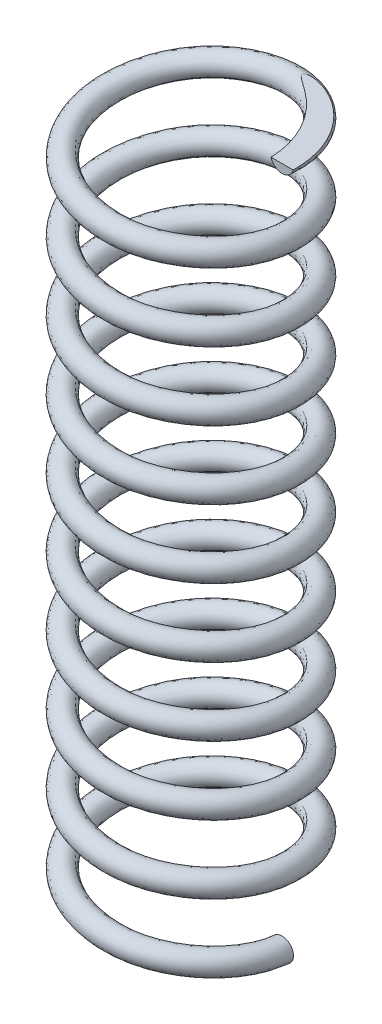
ISO-10303-21;
HEADER;
FILE_DESCRIPTION(('STEP AP214'),'2;1');
FILE_NAME('part.step','',(''),(''),'','','');
FILE_SCHEMA(('AUTOMOTIVE_DESIGN { 1 0 10303 214 1 1 1 1 }'));
ENDSEC;
DATA;
#1=APPLICATION_CONTEXT('core data for automotive mechanical design processes');
#2=APPLICATION_PROTOCOL_DEFINITION('international standard','automotive_design',2000,#1);
#3=PRODUCT_CONTEXT('',#1,'mechanical');
#4=PRODUCT('Part','Part','',(#3));
#5=PRODUCT_RELATED_PRODUCT_CATEGORY('part','',(#4));
#6=PRODUCT_DEFINITION_FORMATION('','',#4);
#7=PRODUCT_DEFINITION_CONTEXT('part definition',#1,'design');
#8=PRODUCT_DEFINITION('design','',#6,#7);
#9=PRODUCT_DEFINITION_SHAPE('','',#8);
#10=(LENGTH_UNIT() NAMED_UNIT(*) SI_UNIT(.MILLI.,.METRE.));
#11=(NAMED_UNIT(*) PLANE_ANGLE_UNIT() SI_UNIT($,.RADIAN.));
#12=(NAMED_UNIT(*) SI_UNIT($,.STERADIAN.) SOLID_ANGLE_UNIT());
#13=UNCERTAINTY_MEASURE_WITH_UNIT(LENGTH_MEASURE(1.E-05),#10,'distance_accuracy_value','');
#14=(GEOMETRIC_REPRESENTATION_CONTEXT(3) GLOBAL_UNCERTAINTY_ASSIGNED_CONTEXT((#13)) GLOBAL_UNIT_ASSIGNED_CONTEXT((#10,
#11,#12)) REPRESENTATION_CONTEXT('',''));
#15=CARTESIAN_POINT('',(0.,0.,0.));
#16=DIRECTION('',(0.,0.,1.));
#17=DIRECTION('',(1.,0.,0.));
#18=AXIS2_PLACEMENT_3D('',#15,#16,#17);
#19=CARTESIAN_POINT('',(8.00043675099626,101.999883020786,0.));
#20=DIRECTION('',(0.,0.,1.));
#21=DIRECTION('',(1.,0.,0.));
#22=AXIS2_PLACEMENT_3D('',#19,#20,#21);
#23=PLANE('',#22);
#24=DIRECTION('',(1.,0.,0.));
#25=VECTOR('',#24,1.);
#26=CARTESIAN_POINT('',(1.88518810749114,101.761523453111,0.));
#27=LINE('',#26,#25);
#28=CARTESIAN_POINT('',(7.0292597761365,101.761523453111,0.));
#29=VERTEX_POINT('',#28);
#30=CARTESIAN_POINT('',(8.97161372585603,101.761523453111,0.));
#31=VERTEX_POINT('',#30);
#32=EDGE_CURVE('E49',#29,#31,#27,.T.);
#33=ORIENTED_EDGE('',*,*,#32,.F.);
#34=CARTESIAN_POINT('',(8.00043675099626,101.999883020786,0.));
#35=DIRECTION('',(0.,0.,1.));
#36=DIRECTION('',(1.,0.,0.));
#37=AXIS2_PLACEMENT_3D('',#34,#35,#36);
#38=CIRCLE('',#37,1.);
#39=EDGE_CURVE('E60',#29,#31,#38,.T.);
#40=ORIENTED_EDGE('',*,*,#39,.T.);
#41=EDGE_LOOP('',(#33,#40));
#42=FACE_BOUND('',#41,.T.);
#43=ADVANCED_FACE('F31',(#42),#23,.T.);
#44=CARTESIAN_POINT('',(8.00043675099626,41.9998830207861,-1.11733502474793E-12));
#45=DIRECTION('',(1.39659253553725E-13,0.,1.));
#46=DIRECTION('',(1.,0.,-1.39659253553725E-13));
#47=AXIS2_PLACEMENT_3D('',#44,#45,#46);
#48=PLANE('',#47);
#49=CARTESIAN_POINT('',(8.00043675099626,41.9998830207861,-1.11733502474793E-12));
#50=DIRECTION('',(1.39659253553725E-13,0.,1.));
#51=DIRECTION('',(1.,0.,-1.39659253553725E-13));
#52=AXIS2_PLACEMENT_3D('',#49,#50,#51);
#53=CIRCLE('',#52,1.);
#54=CARTESIAN_POINT('',(9.00043675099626,41.9998830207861,-1.25699427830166E-12));
#55=VERTEX_POINT('',#54);
#56=EDGE_CURVE('E43',#55,#55,#53,.T.);
#57=ORIENTED_EDGE('',*,*,#56,.F.);
#58=EDGE_LOOP('',(#57));
#59=FACE_BOUND('',#58,.T.);
#60=ADVANCED_FACE('F65',(#59),#48,.F.);
#61=CARTESIAN_POINT('',(9.00043675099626,101.999883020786,0.));
#62=CARTESIAN_POINT('',(9.00043675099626,101.499883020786,-5.19640458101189));
#63=CARTESIAN_POINT('',(4.50021837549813,100.999883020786,-7.79460687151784));
#64=CARTESIAN_POINT('',(0.,100.499883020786,-10.3928091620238));
#65=CARTESIAN_POINT('',(-4.50021837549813,99.999883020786,-7.79460687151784));
#66=CARTESIAN_POINT('',(-9.00043675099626,99.499883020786,-5.1964045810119));
#67=CARTESIAN_POINT('',(-9.00043675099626,98.999883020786,0.));
#68=CARTESIAN_POINT('',(-9.00043675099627,98.499883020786,5.19640458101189));
#69=CARTESIAN_POINT('',(-4.50021837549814,97.999883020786,7.79460687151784));
#70=CARTESIAN_POINT('',(0.,97.499883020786,10.3928091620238));
#71=CARTESIAN_POINT('',(4.50021837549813,96.999883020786,7.79460687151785));
#72=CARTESIAN_POINT('',(9.00043675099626,96.499883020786,5.1964045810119));
#73=CARTESIAN_POINT('',(9.00043675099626,95.999883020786,0.));
#74=CARTESIAN_POINT('',(9.00043675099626,95.499883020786,-5.19640458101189));
#75=CARTESIAN_POINT('',(4.50021837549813,94.999883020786,-7.79460687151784));
#76=CARTESIAN_POINT('',(0.,94.499883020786,-10.3928091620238));
#77=CARTESIAN_POINT('',(-4.50021837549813,93.999883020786,-7.79460687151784));
#78=CARTESIAN_POINT('',(-9.00043675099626,93.499883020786,-5.1964045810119));
#79=CARTESIAN_POINT('',(-9.00043675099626,92.999883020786,0.));
#80=CARTESIAN_POINT('',(-9.00043675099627,92.499883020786,5.19640458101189));
#81=CARTESIAN_POINT('',(-4.50021837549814,91.999883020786,7.79460687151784));
#82=CARTESIAN_POINT('',(0.,91.499883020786,10.3928091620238));
#83=CARTESIAN_POINT('',(4.50021837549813,90.999883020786,7.79460687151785));
#84=CARTESIAN_POINT('',(9.00043675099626,90.4998830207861,5.1964045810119));
#85=CARTESIAN_POINT('',(9.00043675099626,89.999883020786,0.));
#86=CARTESIAN_POINT('',(9.00043675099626,89.4998830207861,-5.19640458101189));
#87=CARTESIAN_POINT('',(4.50021837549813,88.9998830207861,-7.79460687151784));
#88=CARTESIAN_POINT('',(0.,88.4998830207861,-10.3928091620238));
#89=CARTESIAN_POINT('',(-4.50021837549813,87.9998830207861,-7.79460687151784));
#90=CARTESIAN_POINT('',(-9.00043675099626,87.4998830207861,-5.1964045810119));
#91=CARTESIAN_POINT('',(-9.00043675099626,86.9998830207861,0.));
#92=CARTESIAN_POINT('',(-9.00043675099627,86.4998830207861,5.19640458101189));
#93=CARTESIAN_POINT('',(-4.50021837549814,85.9998830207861,7.79460687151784));
#94=CARTESIAN_POINT('',(0.,85.4998830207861,10.3928091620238));
#95=CARTESIAN_POINT('',(4.50021837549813,84.9998830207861,7.79460687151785));
#96=CARTESIAN_POINT('',(9.00043675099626,84.4998830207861,5.1964045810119));
#97=CARTESIAN_POINT('',(9.00043675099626,83.9998830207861,0.));
#98=CARTESIAN_POINT('',(9.00043675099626,83.4998830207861,-5.19640458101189));
#99=CARTESIAN_POINT('',(4.50021837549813,82.9998830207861,-7.79460687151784));
#100=CARTESIAN_POINT('',(0.,82.4998830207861,-10.3928091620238));
#101=CARTESIAN_POINT('',(-4.50021837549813,81.9998830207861,-7.79460687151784));
#102=CARTESIAN_POINT('',(-9.00043675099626,81.4998830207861,-5.1964045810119));
#103=CARTESIAN_POINT('',(-9.00043675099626,80.9998830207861,0.));
#104=CARTESIAN_POINT('',(-9.00043675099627,80.4998830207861,5.19640458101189));
#105=CARTESIAN_POINT('',(-4.50021837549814,79.9998830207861,7.79460687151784));
#106=CARTESIAN_POINT('',(0.,79.4998830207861,10.3928091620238));
#107=CARTESIAN_POINT('',(4.50021837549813,78.9998830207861,7.79460687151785));
#108=CARTESIAN_POINT('',(9.00043675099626,78.4998830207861,5.1964045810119));
#109=CARTESIAN_POINT('',(9.00043675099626,77.9998830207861,0.));
#110=CARTESIAN_POINT('',(9.00043675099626,77.4998830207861,-5.19640458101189));
#111=CARTESIAN_POINT('',(4.50021837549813,76.9998830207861,-7.79460687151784));
#112=CARTESIAN_POINT('',(0.,76.4998830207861,-10.3928091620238));
#113=CARTESIAN_POINT('',(-4.50021837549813,75.9998830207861,-7.79460687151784));
#114=CARTESIAN_POINT('',(-9.00043675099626,75.4998830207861,-5.1964045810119));
#115=CARTESIAN_POINT('',(-9.00043675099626,74.9998830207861,0.));
#116=CARTESIAN_POINT('',(-9.00043675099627,74.4998830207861,5.19640458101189));
#117=CARTESIAN_POINT('',(-4.50021837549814,73.9998830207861,7.79460687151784));
#118=CARTESIAN_POINT('',(0.,73.4998830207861,10.3928091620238));
#119=CARTESIAN_POINT('',(4.50021837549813,72.9998830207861,7.79460687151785));
#120=CARTESIAN_POINT('',(9.00043675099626,72.4998830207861,5.1964045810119));
#121=CARTESIAN_POINT('',(9.00043675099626,71.9998830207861,0.));
#122=CARTESIAN_POINT('',(9.00043675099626,71.4998830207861,-5.19640458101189));
#123=CARTESIAN_POINT('',(4.50021837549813,70.9998830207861,-7.79460687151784));
#124=CARTESIAN_POINT('',(0.,70.4998830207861,-10.3928091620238));
#125=CARTESIAN_POINT('',(-4.50021837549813,69.9998830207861,-7.79460687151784));
#126=CARTESIAN_POINT('',(-9.00043675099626,69.4998830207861,-5.1964045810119));
#127=CARTESIAN_POINT('',(-9.00043675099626,68.9998830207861,0.));
#128=CARTESIAN_POINT('',(-9.00043675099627,68.4998830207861,5.19640458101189));
#129=CARTESIAN_POINT('',(-4.50021837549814,67.9998830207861,7.79460687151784));
#130=CARTESIAN_POINT('',(0.,67.4998830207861,10.3928091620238));
#131=CARTESIAN_POINT('',(4.50021837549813,66.9998830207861,7.79460687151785));
#132=CARTESIAN_POINT('',(9.00043675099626,66.4998830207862,5.1964045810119));
#133=CARTESIAN_POINT('',(9.00043675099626,65.9998830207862,0.));
#134=CARTESIAN_POINT('',(9.00043675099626,65.4998830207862,-5.19640458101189));
#135=CARTESIAN_POINT('',(4.50021837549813,64.9998830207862,-7.79460687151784));
#136=CARTESIAN_POINT('',(0.,64.4998830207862,-10.3928091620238));
#137=CARTESIAN_POINT('',(-4.50021837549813,63.9998830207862,-7.79460687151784));
#138=CARTESIAN_POINT('',(-9.00043675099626,63.4998830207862,-5.1964045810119));
#139=CARTESIAN_POINT('',(-9.00043675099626,62.9998830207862,0.));
#140=CARTESIAN_POINT('',(-9.00043675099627,62.4998830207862,5.19640458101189));
#141=CARTESIAN_POINT('',(-4.50021837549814,61.9998830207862,7.79460687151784));
#142=CARTESIAN_POINT('',(0.,61.4998830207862,10.3928091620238));
#143=CARTESIAN_POINT('',(4.50021837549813,60.9998830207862,7.79460687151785));
#144=CARTESIAN_POINT('',(9.00043675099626,60.4998830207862,5.1964045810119));
#145=CARTESIAN_POINT('',(9.00043675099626,59.9998830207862,0.));
#146=CARTESIAN_POINT('',(9.00043675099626,59.4998830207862,-5.19640458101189));
#147=CARTESIAN_POINT('',(4.50021837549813,58.9998830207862,-7.79460687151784));
#148=CARTESIAN_POINT('',(0.,58.4998830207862,-10.3928091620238));
#149=CARTESIAN_POINT('',(-4.50021837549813,57.9998830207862,-7.79460687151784));
#150=CARTESIAN_POINT('',(-9.00043675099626,57.4998830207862,-5.1964045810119));
#151=CARTESIAN_POINT('',(-9.00043675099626,56.9998830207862,0.));
#152=CARTESIAN_POINT('',(-9.00043675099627,56.4998830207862,5.19640458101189));
#153=CARTESIAN_POINT('',(-4.50021837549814,55.9998830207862,7.79460687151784));
#154=CARTESIAN_POINT('',(0.,55.4998830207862,10.3928091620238));
#155=CARTESIAN_POINT('',(4.50021837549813,54.9998830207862,7.79460687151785));
#156=CARTESIAN_POINT('',(9.00043675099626,54.4998830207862,5.1964045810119));
#157=CARTESIAN_POINT('',(9.00043675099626,53.9998830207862,0.));
#158=CARTESIAN_POINT('',(9.00043675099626,53.4998830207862,-5.19640458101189));
#159=CARTESIAN_POINT('',(4.50021837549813,52.9998830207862,-7.79460687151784));
#160=CARTESIAN_POINT('',(0.,52.4998830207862,-10.3928091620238));
#161=CARTESIAN_POINT('',(-4.50021837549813,51.9998830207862,-7.79460687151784));
#162=CARTESIAN_POINT('',(-9.00043675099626,51.4998830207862,-5.1964045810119));
#163=CARTESIAN_POINT('',(-9.00043675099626,50.9998830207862,0.));
#164=CARTESIAN_POINT('',(-9.00043675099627,50.4998830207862,5.19640458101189));
#165=CARTESIAN_POINT('',(-4.50021837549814,49.9998830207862,7.79460687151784));
#166=CARTESIAN_POINT('',(0.,49.4998830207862,10.3928091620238));
#167=CARTESIAN_POINT('',(4.50021837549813,48.9998830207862,7.79460687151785));
#168=CARTESIAN_POINT('',(9.00043675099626,48.4998830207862,5.1964045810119));
#169=CARTESIAN_POINT('',(9.00043675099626,47.9998830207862,0.));
#170=CARTESIAN_POINT('',(9.00043675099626,47.4998830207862,-5.19640458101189));
#171=CARTESIAN_POINT('',(4.50021837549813,46.9998830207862,-7.79460687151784));
#172=CARTESIAN_POINT('',(0.,46.4998830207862,-10.3928091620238));
#173=CARTESIAN_POINT('',(-4.50021837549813,45.9998830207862,-7.79460687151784));
#174=CARTESIAN_POINT('',(-9.00043675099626,45.4998830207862,-5.1964045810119));
#175=CARTESIAN_POINT('',(-9.00043675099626,44.9998830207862,0.));
#176=CARTESIAN_POINT('',(-9.00043675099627,44.4998830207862,5.19640458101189));
#177=CARTESIAN_POINT('',(-4.50021837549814,43.9998830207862,7.79460687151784));
#178=CARTESIAN_POINT('',(0.,43.4998830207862,10.3928091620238));
#179=CARTESIAN_POINT('',(4.50021837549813,42.9998830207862,7.79460687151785));
#180=CARTESIAN_POINT('',(9.00043675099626,42.4998830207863,5.1964045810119));
#181=CARTESIAN_POINT('',(9.00043675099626,41.9998830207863,0.));
#182=CARTESIAN_POINT('',(9.00043675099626,41.4998830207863,-5.19640458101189));
#183=CARTESIAN_POINT('',(4.50021837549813,40.9998830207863,-7.79460687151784));
#184=CARTESIAN_POINT('',(0.,40.4998830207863,-10.3928091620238));
#185=CARTESIAN_POINT('',(-4.50021837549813,39.9998830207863,-7.79460687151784));
#186=CARTESIAN_POINT('',(-9.00043675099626,39.4998830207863,-5.1964045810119));
#187=CARTESIAN_POINT('',(-9.00043675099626,38.9998830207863,0.));
#188=CARTESIAN_POINT('',(-9.00043675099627,38.4998830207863,5.19640458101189));
#189=CARTESIAN_POINT('',(-4.50021837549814,37.9998830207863,7.79460687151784));
#190=CARTESIAN_POINT('',(0.,37.4998830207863,10.3928091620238));
#191=CARTESIAN_POINT('',(4.50021837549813,36.9998830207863,7.79460687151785));
#192=CARTESIAN_POINT('',(9.00043675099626,36.4998830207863,5.1964045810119));
#193=CARTESIAN_POINT('',(9.00043675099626,35.9998830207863,0.));
#194=CARTESIAN_POINT('',(9.00043675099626,103.999883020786,0.));
#195=CARTESIAN_POINT('',(9.00043675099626,103.499883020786,-5.19640458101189));
#196=CARTESIAN_POINT('',(4.50021837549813,102.999883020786,-7.79460687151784));
#197=CARTESIAN_POINT('',(0.,102.499883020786,-10.3928091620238));
#198=CARTESIAN_POINT('',(-4.50021837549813,101.999883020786,-7.79460687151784));
#199=CARTESIAN_POINT('',(-9.00043675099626,101.499883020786,-5.1964045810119));
#200=CARTESIAN_POINT('',(-9.00043675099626,100.999883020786,0.));
#201=CARTESIAN_POINT('',(-9.00043675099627,100.499883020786,5.19640458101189));
#202=CARTESIAN_POINT('',(-4.50021837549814,99.999883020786,7.79460687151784));
#203=CARTESIAN_POINT('',(0.,99.499883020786,10.3928091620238));
#204=CARTESIAN_POINT('',(4.50021837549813,98.999883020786,7.79460687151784));
#205=CARTESIAN_POINT('',(9.00043675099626,98.499883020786,5.1964045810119));
#206=CARTESIAN_POINT('',(9.00043675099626,97.999883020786,0.));
#207=CARTESIAN_POINT('',(9.00043675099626,97.499883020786,-5.19640458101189));
#208=CARTESIAN_POINT('',(4.50021837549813,96.999883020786,-7.79460687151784));
#209=CARTESIAN_POINT('',(0.,96.499883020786,-10.3928091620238));
#210=CARTESIAN_POINT('',(-4.50021837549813,95.999883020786,-7.79460687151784));
#211=CARTESIAN_POINT('',(-9.00043675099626,95.499883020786,-5.1964045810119));
#212=CARTESIAN_POINT('',(-9.00043675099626,94.999883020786,0.));
#213=CARTESIAN_POINT('',(-9.00043675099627,94.499883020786,5.19640458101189));
#214=CARTESIAN_POINT('',(-4.50021837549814,93.999883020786,7.79460687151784));
#215=CARTESIAN_POINT('',(0.,93.4998830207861,10.3928091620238));
#216=CARTESIAN_POINT('',(4.50021837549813,92.999883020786,7.79460687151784));
#217=CARTESIAN_POINT('',(9.00043675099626,92.499883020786,5.1964045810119));
#218=CARTESIAN_POINT('',(9.00043675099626,91.999883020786,0.));
#219=CARTESIAN_POINT('',(9.00043675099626,91.4998830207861,-5.19640458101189));
#220=CARTESIAN_POINT('',(4.50021837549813,90.9998830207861,-7.79460687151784));
#221=CARTESIAN_POINT('',(0.,90.4998830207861,-10.3928091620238));
#222=CARTESIAN_POINT('',(-4.50021837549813,89.9998830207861,-7.79460687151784));
#223=CARTESIAN_POINT('',(-9.00043675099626,89.4998830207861,-5.1964045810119));
#224=CARTESIAN_POINT('',(-9.00043675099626,88.9998830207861,0.));
#225=CARTESIAN_POINT('',(-9.00043675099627,88.4998830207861,5.19640458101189));
#226=CARTESIAN_POINT('',(-4.50021837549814,87.9998830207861,7.79460687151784));
#227=CARTESIAN_POINT('',(0.,87.4998830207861,10.3928091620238));
#228=CARTESIAN_POINT('',(4.50021837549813,86.9998830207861,7.79460687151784));
#229=CARTESIAN_POINT('',(9.00043675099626,86.4998830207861,5.1964045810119));
#230=CARTESIAN_POINT('',(9.00043675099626,85.9998830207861,0.));
#231=CARTESIAN_POINT('',(9.00043675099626,85.4998830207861,-5.19640458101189));
#232=CARTESIAN_POINT('',(4.50021837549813,84.9998830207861,-7.79460687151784));
#233=CARTESIAN_POINT('',(0.,84.4998830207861,-10.3928091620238));
#234=CARTESIAN_POINT('',(-4.50021837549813,83.9998830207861,-7.79460687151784));
#235=CARTESIAN_POINT('',(-9.00043675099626,83.4998830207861,-5.1964045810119));
#236=CARTESIAN_POINT('',(-9.00043675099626,82.9998830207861,0.));
#237=CARTESIAN_POINT('',(-9.00043675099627,82.4998830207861,5.19640458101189));
#238=CARTESIAN_POINT('',(-4.50021837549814,81.9998830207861,7.79460687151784));
#239=CARTESIAN_POINT('',(0.,81.4998830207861,10.3928091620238));
#240=CARTESIAN_POINT('',(4.50021837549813,80.9998830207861,7.79460687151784));
#241=CARTESIAN_POINT('',(9.00043675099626,80.4998830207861,5.1964045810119));
#242=CARTESIAN_POINT('',(9.00043675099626,79.9998830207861,0.));
#243=CARTESIAN_POINT('',(9.00043675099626,79.4998830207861,-5.19640458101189));
#244=CARTESIAN_POINT('',(4.50021837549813,78.9998830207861,-7.79460687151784));
#245=CARTESIAN_POINT('',(0.,78.4998830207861,-10.3928091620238));
#246=CARTESIAN_POINT('',(-4.50021837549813,77.9998830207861,-7.79460687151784));
#247=CARTESIAN_POINT('',(-9.00043675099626,77.4998830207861,-5.1964045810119));
#248=CARTESIAN_POINT('',(-9.00043675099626,76.9998830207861,0.));
#249=CARTESIAN_POINT('',(-9.00043675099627,76.4998830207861,5.19640458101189));
#250=CARTESIAN_POINT('',(-4.50021837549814,75.9998830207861,7.79460687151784));
#251=CARTESIAN_POINT('',(0.,75.4998830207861,10.3928091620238));
#252=CARTESIAN_POINT('',(4.50021837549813,74.9998830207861,7.79460687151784));
#253=CARTESIAN_POINT('',(9.00043675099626,74.4998830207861,5.1964045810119));
#254=CARTESIAN_POINT('',(9.00043675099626,73.9998830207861,0.));
#255=CARTESIAN_POINT('',(9.00043675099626,73.4998830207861,-5.19640458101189));
#256=CARTESIAN_POINT('',(4.50021837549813,72.9998830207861,-7.79460687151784));
#257=CARTESIAN_POINT('',(0.,72.4998830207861,-10.3928091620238));
#258=CARTESIAN_POINT('',(-4.50021837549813,71.9998830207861,-7.79460687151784));
#259=CARTESIAN_POINT('',(-9.00043675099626,71.4998830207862,-5.1964045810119));
#260=CARTESIAN_POINT('',(-9.00043675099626,70.9998830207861,0.));
#261=CARTESIAN_POINT('',(-9.00043675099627,70.4998830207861,5.19640458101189));
#262=CARTESIAN_POINT('',(-4.50021837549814,69.9998830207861,7.79460687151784));
#263=CARTESIAN_POINT('',(0.,69.4998830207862,10.3928091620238));
#264=CARTESIAN_POINT('',(4.50021837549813,68.9998830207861,7.79460687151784));
#265=CARTESIAN_POINT('',(9.00043675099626,68.4998830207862,5.1964045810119));
#266=CARTESIAN_POINT('',(9.00043675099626,67.9998830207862,0.));
#267=CARTESIAN_POINT('',(9.00043675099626,67.4998830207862,-5.19640458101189));
#268=CARTESIAN_POINT('',(4.50021837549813,66.9998830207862,-7.79460687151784));
#269=CARTESIAN_POINT('',(0.,66.4998830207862,-10.3928091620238));
#270=CARTESIAN_POINT('',(-4.50021837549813,65.9998830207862,-7.79460687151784));
#271=CARTESIAN_POINT('',(-9.00043675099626,65.4998830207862,-5.1964045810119));
#272=CARTESIAN_POINT('',(-9.00043675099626,64.9998830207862,0.));
#273=CARTESIAN_POINT('',(-9.00043675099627,64.4998830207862,5.19640458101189));
#274=CARTESIAN_POINT('',(-4.50021837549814,63.9998830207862,7.79460687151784));
#275=CARTESIAN_POINT('',(0.,63.4998830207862,10.3928091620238));
#276=CARTESIAN_POINT('',(4.50021837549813,62.9998830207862,7.79460687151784));
#277=CARTESIAN_POINT('',(9.00043675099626,62.4998830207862,5.1964045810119));
#278=CARTESIAN_POINT('',(9.00043675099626,61.9998830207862,0.));
#279=CARTESIAN_POINT('',(9.00043675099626,61.4998830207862,-5.19640458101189));
#280=CARTESIAN_POINT('',(4.50021837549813,60.9998830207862,-7.79460687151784));
#281=CARTESIAN_POINT('',(0.,60.4998830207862,-10.3928091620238));
#282=CARTESIAN_POINT('',(-4.50021837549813,59.9998830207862,-7.79460687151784));
#283=CARTESIAN_POINT('',(-9.00043675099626,59.4998830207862,-5.1964045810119));
#284=CARTESIAN_POINT('',(-9.00043675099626,58.9998830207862,0.));
#285=CARTESIAN_POINT('',(-9.00043675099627,58.4998830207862,5.19640458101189));
#286=CARTESIAN_POINT('',(-4.50021837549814,57.9998830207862,7.79460687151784));
#287=CARTESIAN_POINT('',(0.,57.4998830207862,10.3928091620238));
#288=CARTESIAN_POINT('',(4.50021837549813,56.9998830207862,7.79460687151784));
#289=CARTESIAN_POINT('',(9.00043675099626,56.4998830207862,5.1964045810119));
#290=CARTESIAN_POINT('',(9.00043675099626,55.9998830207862,0.));
#291=CARTESIAN_POINT('',(9.00043675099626,55.4998830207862,-5.19640458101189));
#292=CARTESIAN_POINT('',(4.50021837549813,54.9998830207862,-7.79460687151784));
#293=CARTESIAN_POINT('',(0.,54.4998830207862,-10.3928091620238));
#294=CARTESIAN_POINT('',(-4.50021837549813,53.9998830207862,-7.79460687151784));
#295=CARTESIAN_POINT('',(-9.00043675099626,53.4998830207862,-5.1964045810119));
#296=CARTESIAN_POINT('',(-9.00043675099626,52.9998830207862,0.));
#297=CARTESIAN_POINT('',(-9.00043675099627,52.4998830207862,5.19640458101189));
#298=CARTESIAN_POINT('',(-4.50021837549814,51.9998830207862,7.79460687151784));
#299=CARTESIAN_POINT('',(0.,51.4998830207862,10.3928091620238));
#300=CARTESIAN_POINT('',(4.50021837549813,50.9998830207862,7.79460687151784));
#301=CARTESIAN_POINT('',(9.00043675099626,50.4998830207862,5.1964045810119));
#302=CARTESIAN_POINT('',(9.00043675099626,49.9998830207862,0.));
#303=CARTESIAN_POINT('',(9.00043675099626,49.4998830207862,-5.19640458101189));
#304=CARTESIAN_POINT('',(4.50021837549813,48.9998830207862,-7.79460687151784));
#305=CARTESIAN_POINT('',(0.,48.4998830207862,-10.3928091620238));
#306=CARTESIAN_POINT('',(-4.50021837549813,47.9998830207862,-7.79460687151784));
#307=CARTESIAN_POINT('',(-9.00043675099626,47.4998830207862,-5.1964045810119));
#308=CARTESIAN_POINT('',(-9.00043675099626,46.9998830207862,0.));
#309=CARTESIAN_POINT('',(-9.00043675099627,46.4998830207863,5.19640458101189));
#310=CARTESIAN_POINT('',(-4.50021837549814,45.9998830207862,7.79460687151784));
#311=CARTESIAN_POINT('',(0.,45.4998830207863,10.3928091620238));
#312=CARTESIAN_POINT('',(4.50021837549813,44.9998830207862,7.79460687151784));
#313=CARTESIAN_POINT('',(9.00043675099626,44.4998830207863,5.1964045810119));
#314=CARTESIAN_POINT('',(9.00043675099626,43.9998830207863,0.));
#315=CARTESIAN_POINT('',(9.00043675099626,43.4998830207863,-5.19640458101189));
#316=CARTESIAN_POINT('',(4.50021837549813,42.9998830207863,-7.79460687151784));
#317=CARTESIAN_POINT('',(0.,42.4998830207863,-10.3928091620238));
#318=CARTESIAN_POINT('',(-4.50021837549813,41.9998830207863,-7.79460687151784));
#319=CARTESIAN_POINT('',(-9.00043675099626,41.4998830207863,-5.1964045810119));
#320=CARTESIAN_POINT('',(-9.00043675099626,40.9998830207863,0.));
#321=CARTESIAN_POINT('',(-9.00043675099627,40.4998830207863,5.19640458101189));
#322=CARTESIAN_POINT('',(-4.50021837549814,39.9998830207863,7.79460687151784));
#323=CARTESIAN_POINT('',(0.,39.4998830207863,10.3928091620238));
#324=CARTESIAN_POINT('',(4.50021837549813,38.9998830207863,7.79460687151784));
#325=CARTESIAN_POINT('',(9.00043675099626,38.4998830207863,5.1964045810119));
#326=CARTESIAN_POINT('',(9.00043675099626,37.9998830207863,0.));
#327=CARTESIAN_POINT('',(7.00043675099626,103.999883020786,0.));
#328=CARTESIAN_POINT('',(7.00043675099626,103.499883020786,-4.04170404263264));
#329=CARTESIAN_POINT('',(3.50021837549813,102.999883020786,-6.06255606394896));
#330=CARTESIAN_POINT('',(0.,102.499883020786,-8.08340808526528));
#331=CARTESIAN_POINT('',(-3.50021837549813,101.999883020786,-6.06255606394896));
#332=CARTESIAN_POINT('',(-7.00043675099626,101.499883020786,-4.04170404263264));
#333=CARTESIAN_POINT('',(-7.00043675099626,100.999883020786,0.));
#334=CARTESIAN_POINT('',(-7.00043675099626,100.499883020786,4.04170404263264));
#335=CARTESIAN_POINT('',(-3.50021837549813,99.999883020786,6.06255606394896));
#336=CARTESIAN_POINT('',(0.,99.499883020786,8.08340808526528));
#337=CARTESIAN_POINT('',(3.50021837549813,98.999883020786,6.06255606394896));
#338=CARTESIAN_POINT('',(7.00043675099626,98.499883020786,4.04170404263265));
#339=CARTESIAN_POINT('',(7.00043675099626,97.999883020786,0.));
#340=CARTESIAN_POINT('',(7.00043675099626,97.499883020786,-4.04170404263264));
#341=CARTESIAN_POINT('',(3.50021837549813,96.999883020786,-6.06255606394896));
#342=CARTESIAN_POINT('',(0.,96.499883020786,-8.08340808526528));
#343=CARTESIAN_POINT('',(-3.50021837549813,95.999883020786,-6.06255606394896));
#344=CARTESIAN_POINT('',(-7.00043675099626,95.499883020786,-4.04170404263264));
#345=CARTESIAN_POINT('',(-7.00043675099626,94.999883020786,0.));
#346=CARTESIAN_POINT('',(-7.00043675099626,94.499883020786,4.04170404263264));
#347=CARTESIAN_POINT('',(-3.50021837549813,93.999883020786,6.06255606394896));
#348=CARTESIAN_POINT('',(0.,93.4998830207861,8.08340808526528));
#349=CARTESIAN_POINT('',(3.50021837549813,92.999883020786,6.06255606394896));
#350=CARTESIAN_POINT('',(7.00043675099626,92.499883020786,4.04170404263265));
#351=CARTESIAN_POINT('',(7.00043675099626,91.999883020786,0.));
#352=CARTESIAN_POINT('',(7.00043675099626,91.4998830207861,-4.04170404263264));
#353=CARTESIAN_POINT('',(3.50021837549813,90.9998830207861,-6.06255606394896));
#354=CARTESIAN_POINT('',(0.,90.4998830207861,-8.08340808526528));
#355=CARTESIAN_POINT('',(-3.50021837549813,89.9998830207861,-6.06255606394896));
#356=CARTESIAN_POINT('',(-7.00043675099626,89.4998830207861,-4.04170404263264));
#357=CARTESIAN_POINT('',(-7.00043675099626,88.9998830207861,0.));
#358=CARTESIAN_POINT('',(-7.00043675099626,88.4998830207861,4.04170404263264));
#359=CARTESIAN_POINT('',(-3.50021837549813,87.9998830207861,6.06255606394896));
#360=CARTESIAN_POINT('',(0.,87.4998830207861,8.08340808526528));
#361=CARTESIAN_POINT('',(3.50021837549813,86.9998830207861,6.06255606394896));
#362=CARTESIAN_POINT('',(7.00043675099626,86.4998830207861,4.04170404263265));
#363=CARTESIAN_POINT('',(7.00043675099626,85.9998830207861,0.));
#364=CARTESIAN_POINT('',(7.00043675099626,85.4998830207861,-4.04170404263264));
#365=CARTESIAN_POINT('',(3.50021837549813,84.9998830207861,-6.06255606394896));
#366=CARTESIAN_POINT('',(0.,84.4998830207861,-8.08340808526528));
#367=CARTESIAN_POINT('',(-3.50021837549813,83.9998830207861,-6.06255606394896));
#368=CARTESIAN_POINT('',(-7.00043675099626,83.4998830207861,-4.04170404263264));
#369=CARTESIAN_POINT('',(-7.00043675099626,82.9998830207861,0.));
#370=CARTESIAN_POINT('',(-7.00043675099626,82.4998830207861,4.04170404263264));
#371=CARTESIAN_POINT('',(-3.50021837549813,81.9998830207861,6.06255606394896));
#372=CARTESIAN_POINT('',(0.,81.4998830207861,8.08340808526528));
#373=CARTESIAN_POINT('',(3.50021837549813,80.9998830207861,6.06255606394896));
#374=CARTESIAN_POINT('',(7.00043675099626,80.4998830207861,4.04170404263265));
#375=CARTESIAN_POINT('',(7.00043675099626,79.9998830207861,0.));
#376=CARTESIAN_POINT('',(7.00043675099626,79.4998830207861,-4.04170404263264));
#377=CARTESIAN_POINT('',(3.50021837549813,78.9998830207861,-6.06255606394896));
#378=CARTESIAN_POINT('',(0.,78.4998830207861,-8.08340808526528));
#379=CARTESIAN_POINT('',(-3.50021837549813,77.9998830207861,-6.06255606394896));
#380=CARTESIAN_POINT('',(-7.00043675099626,77.4998830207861,-4.04170404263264));
#381=CARTESIAN_POINT('',(-7.00043675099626,76.9998830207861,0.));
#382=CARTESIAN_POINT('',(-7.00043675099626,76.4998830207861,4.04170404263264));
#383=CARTESIAN_POINT('',(-3.50021837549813,75.9998830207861,6.06255606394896));
#384=CARTESIAN_POINT('',(0.,75.4998830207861,8.08340808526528));
#385=CARTESIAN_POINT('',(3.50021837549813,74.9998830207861,6.06255606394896));
#386=CARTESIAN_POINT('',(7.00043675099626,74.4998830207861,4.04170404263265));
#387=CARTESIAN_POINT('',(7.00043675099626,73.9998830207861,0.));
#388=CARTESIAN_POINT('',(7.00043675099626,73.4998830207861,-4.04170404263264));
#389=CARTESIAN_POINT('',(3.50021837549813,72.9998830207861,-6.06255606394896));
#390=CARTESIAN_POINT('',(0.,72.4998830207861,-8.08340808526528));
#391=CARTESIAN_POINT('',(-3.50021837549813,71.9998830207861,-6.06255606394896));
#392=CARTESIAN_POINT('',(-7.00043675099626,71.4998830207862,-4.04170404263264));
#393=CARTESIAN_POINT('',(-7.00043675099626,70.9998830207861,0.));
#394=CARTESIAN_POINT('',(-7.00043675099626,70.4998830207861,4.04170404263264));
#395=CARTESIAN_POINT('',(-3.50021837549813,69.9998830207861,6.06255606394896));
#396=CARTESIAN_POINT('',(0.,69.4998830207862,8.08340808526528));
#397=CARTESIAN_POINT('',(3.50021837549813,68.9998830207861,6.06255606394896));
#398=CARTESIAN_POINT('',(7.00043675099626,68.4998830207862,4.04170404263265));
#399=CARTESIAN_POINT('',(7.00043675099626,67.9998830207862,0.));
#400=CARTESIAN_POINT('',(7.00043675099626,67.4998830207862,-4.04170404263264));
#401=CARTESIAN_POINT('',(3.50021837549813,66.9998830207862,-6.06255606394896));
#402=CARTESIAN_POINT('',(0.,66.4998830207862,-8.08340808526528));
#403=CARTESIAN_POINT('',(-3.50021837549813,65.9998830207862,-6.06255606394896));
#404=CARTESIAN_POINT('',(-7.00043675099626,65.4998830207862,-4.04170404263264));
#405=CARTESIAN_POINT('',(-7.00043675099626,64.9998830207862,0.));
#406=CARTESIAN_POINT('',(-7.00043675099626,64.4998830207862,4.04170404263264));
#407=CARTESIAN_POINT('',(-3.50021837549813,63.9998830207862,6.06255606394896));
#408=CARTESIAN_POINT('',(0.,63.4998830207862,8.08340808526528));
#409=CARTESIAN_POINT('',(3.50021837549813,62.9998830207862,6.06255606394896));
#410=CARTESIAN_POINT('',(7.00043675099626,62.4998830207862,4.04170404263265));
#411=CARTESIAN_POINT('',(7.00043675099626,61.9998830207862,0.));
#412=CARTESIAN_POINT('',(7.00043675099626,61.4998830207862,-4.04170404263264));
#413=CARTESIAN_POINT('',(3.50021837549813,60.9998830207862,-6.06255606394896));
#414=CARTESIAN_POINT('',(0.,60.4998830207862,-8.08340808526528));
#415=CARTESIAN_POINT('',(-3.50021837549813,59.9998830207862,-6.06255606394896));
#416=CARTESIAN_POINT('',(-7.00043675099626,59.4998830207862,-4.04170404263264));
#417=CARTESIAN_POINT('',(-7.00043675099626,58.9998830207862,0.));
#418=CARTESIAN_POINT('',(-7.00043675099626,58.4998830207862,4.04170404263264));
#419=CARTESIAN_POINT('',(-3.50021837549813,57.9998830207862,6.06255606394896));
#420=CARTESIAN_POINT('',(0.,57.4998830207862,8.08340808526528));
#421=CARTESIAN_POINT('',(3.50021837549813,56.9998830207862,6.06255606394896));
#422=CARTESIAN_POINT('',(7.00043675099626,56.4998830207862,4.04170404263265));
#423=CARTESIAN_POINT('',(7.00043675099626,55.9998830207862,0.));
#424=CARTESIAN_POINT('',(7.00043675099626,55.4998830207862,-4.04170404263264));
#425=CARTESIAN_POINT('',(3.50021837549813,54.9998830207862,-6.06255606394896));
#426=CARTESIAN_POINT('',(0.,54.4998830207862,-8.08340808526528));
#427=CARTESIAN_POINT('',(-3.50021837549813,53.9998830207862,-6.06255606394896));
#428=CARTESIAN_POINT('',(-7.00043675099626,53.4998830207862,-4.04170404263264));
#429=CARTESIAN_POINT('',(-7.00043675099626,52.9998830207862,0.));
#430=CARTESIAN_POINT('',(-7.00043675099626,52.4998830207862,4.04170404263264));
#431=CARTESIAN_POINT('',(-3.50021837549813,51.9998830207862,6.06255606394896));
#432=CARTESIAN_POINT('',(0.,51.4998830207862,8.08340808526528));
#433=CARTESIAN_POINT('',(3.50021837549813,50.9998830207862,6.06255606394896));
#434=CARTESIAN_POINT('',(7.00043675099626,50.4998830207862,4.04170404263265));
#435=CARTESIAN_POINT('',(7.00043675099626,49.9998830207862,0.));
#436=CARTESIAN_POINT('',(7.00043675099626,49.4998830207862,-4.04170404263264));
#437=CARTESIAN_POINT('',(3.50021837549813,48.9998830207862,-6.06255606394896));
#438=CARTESIAN_POINT('',(0.,48.4998830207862,-8.08340808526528));
#439=CARTESIAN_POINT('',(-3.50021837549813,47.9998830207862,-6.06255606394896));
#440=CARTESIAN_POINT('',(-7.00043675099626,47.4998830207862,-4.04170404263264));
#441=CARTESIAN_POINT('',(-7.00043675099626,46.9998830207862,0.));
#442=CARTESIAN_POINT('',(-7.00043675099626,46.4998830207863,4.04170404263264));
#443=CARTESIAN_POINT('',(-3.50021837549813,45.9998830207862,6.06255606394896));
#444=CARTESIAN_POINT('',(0.,45.4998830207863,8.08340808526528));
#445=CARTESIAN_POINT('',(3.50021837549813,44.9998830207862,6.06255606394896));
#446=CARTESIAN_POINT('',(7.00043675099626,44.4998830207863,4.04170404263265));
#447=CARTESIAN_POINT('',(7.00043675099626,43.9998830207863,0.));
#448=CARTESIAN_POINT('',(7.00043675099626,43.4998830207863,-4.04170404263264));
#449=CARTESIAN_POINT('',(3.50021837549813,42.9998830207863,-6.06255606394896));
#450=CARTESIAN_POINT('',(0.,42.4998830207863,-8.08340808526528));
#451=CARTESIAN_POINT('',(-3.50021837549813,41.9998830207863,-6.06255606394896));
#452=CARTESIAN_POINT('',(-7.00043675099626,41.4998830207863,-4.04170404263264));
#453=CARTESIAN_POINT('',(-7.00043675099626,40.9998830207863,0.));
#454=CARTESIAN_POINT('',(-7.00043675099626,40.4998830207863,4.04170404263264));
#455=CARTESIAN_POINT('',(-3.50021837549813,39.9998830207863,6.06255606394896));
#456=CARTESIAN_POINT('',(0.,39.4998830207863,8.08340808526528));
#457=CARTESIAN_POINT('',(3.50021837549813,38.9998830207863,6.06255606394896));
#458=CARTESIAN_POINT('',(7.00043675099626,38.4998830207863,4.04170404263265));
#459=CARTESIAN_POINT('',(7.00043675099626,37.9998830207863,0.));
#460=CARTESIAN_POINT('',(7.00043675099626,101.999883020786,0.));
#461=CARTESIAN_POINT('',(7.00043675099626,101.499883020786,-4.04170404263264));
#462=CARTESIAN_POINT('',(3.50021837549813,100.999883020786,-6.06255606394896));
#463=CARTESIAN_POINT('',(0.,100.499883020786,-8.08340808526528));
#464=CARTESIAN_POINT('',(-3.50021837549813,99.999883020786,-6.06255606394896));
#465=CARTESIAN_POINT('',(-7.00043675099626,99.499883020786,-4.04170404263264));
#466=CARTESIAN_POINT('',(-7.00043675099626,98.999883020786,0.));
#467=CARTESIAN_POINT('',(-7.00043675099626,98.499883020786,4.04170404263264));
#468=CARTESIAN_POINT('',(-3.50021837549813,97.999883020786,6.06255606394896));
#469=CARTESIAN_POINT('',(0.,97.499883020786,8.08340808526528));
#470=CARTESIAN_POINT('',(3.50021837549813,96.999883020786,6.06255606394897));
#471=CARTESIAN_POINT('',(7.00043675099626,96.499883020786,4.04170404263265));
#472=CARTESIAN_POINT('',(7.00043675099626,95.999883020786,0.));
#473=CARTESIAN_POINT('',(7.00043675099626,95.499883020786,-4.04170404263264));
#474=CARTESIAN_POINT('',(3.50021837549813,94.999883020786,-6.06255606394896));
#475=CARTESIAN_POINT('',(0.,94.499883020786,-8.08340808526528));
#476=CARTESIAN_POINT('',(-3.50021837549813,93.999883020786,-6.06255606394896));
#477=CARTESIAN_POINT('',(-7.00043675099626,93.499883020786,-4.04170404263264));
#478=CARTESIAN_POINT('',(-7.00043675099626,92.999883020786,0.));
#479=CARTESIAN_POINT('',(-7.00043675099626,92.499883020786,4.04170404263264));
#480=CARTESIAN_POINT('',(-3.50021837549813,91.999883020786,6.06255606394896));
#481=CARTESIAN_POINT('',(0.,91.499883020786,8.08340808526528));
#482=CARTESIAN_POINT('',(3.50021837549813,90.999883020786,6.06255606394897));
#483=CARTESIAN_POINT('',(7.00043675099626,90.4998830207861,4.04170404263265));
#484=CARTESIAN_POINT('',(7.00043675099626,89.999883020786,0.));
#485=CARTESIAN_POINT('',(7.00043675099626,89.4998830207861,-4.04170404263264));
#486=CARTESIAN_POINT('',(3.50021837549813,88.9998830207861,-6.06255606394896));
#487=CARTESIAN_POINT('',(0.,88.4998830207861,-8.08340808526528));
#488=CARTESIAN_POINT('',(-3.50021837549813,87.9998830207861,-6.06255606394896));
#489=CARTESIAN_POINT('',(-7.00043675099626,87.4998830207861,-4.04170404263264));
#490=CARTESIAN_POINT('',(-7.00043675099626,86.9998830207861,0.));
#491=CARTESIAN_POINT('',(-7.00043675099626,86.4998830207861,4.04170404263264));
#492=CARTESIAN_POINT('',(-3.50021837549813,85.9998830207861,6.06255606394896));
#493=CARTESIAN_POINT('',(0.,85.4998830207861,8.08340808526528));
#494=CARTESIAN_POINT('',(3.50021837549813,84.9998830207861,6.06255606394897));
#495=CARTESIAN_POINT('',(7.00043675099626,84.4998830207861,4.04170404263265));
#496=CARTESIAN_POINT('',(7.00043675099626,83.9998830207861,0.));
#497=CARTESIAN_POINT('',(7.00043675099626,83.4998830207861,-4.04170404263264));
#498=CARTESIAN_POINT('',(3.50021837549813,82.9998830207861,-6.06255606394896));
#499=CARTESIAN_POINT('',(0.,82.4998830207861,-8.08340808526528));
#500=CARTESIAN_POINT('',(-3.50021837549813,81.9998830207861,-6.06255606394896));
#501=CARTESIAN_POINT('',(-7.00043675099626,81.4998830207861,-4.04170404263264));
#502=CARTESIAN_POINT('',(-7.00043675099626,80.9998830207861,0.));
#503=CARTESIAN_POINT('',(-7.00043675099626,80.4998830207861,4.04170404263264));
#504=CARTESIAN_POINT('',(-3.50021837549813,79.9998830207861,6.06255606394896));
#505=CARTESIAN_POINT('',(0.,79.4998830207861,8.08340808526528));
#506=CARTESIAN_POINT('',(3.50021837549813,78.9998830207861,6.06255606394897));
#507=CARTESIAN_POINT('',(7.00043675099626,78.4998830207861,4.04170404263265));
#508=CARTESIAN_POINT('',(7.00043675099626,77.9998830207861,0.));
#509=CARTESIAN_POINT('',(7.00043675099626,77.4998830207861,-4.04170404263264));
#510=CARTESIAN_POINT('',(3.50021837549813,76.9998830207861,-6.06255606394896));
#511=CARTESIAN_POINT('',(0.,76.4998830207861,-8.08340808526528));
#512=CARTESIAN_POINT('',(-3.50021837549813,75.9998830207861,-6.06255606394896));
#513=CARTESIAN_POINT('',(-7.00043675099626,75.4998830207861,-4.04170404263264));
#514=CARTESIAN_POINT('',(-7.00043675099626,74.9998830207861,0.));
#515=CARTESIAN_POINT('',(-7.00043675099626,74.4998830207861,4.04170404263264));
#516=CARTESIAN_POINT('',(-3.50021837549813,73.9998830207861,6.06255606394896));
#517=CARTESIAN_POINT('',(0.,73.4998830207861,8.08340808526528));
#518=CARTESIAN_POINT('',(3.50021837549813,72.9998830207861,6.06255606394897));
#519=CARTESIAN_POINT('',(7.00043675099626,72.4998830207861,4.04170404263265));
#520=CARTESIAN_POINT('',(7.00043675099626,71.9998830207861,0.));
#521=CARTESIAN_POINT('',(7.00043675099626,71.4998830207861,-4.04170404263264));
#522=CARTESIAN_POINT('',(3.50021837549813,70.9998830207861,-6.06255606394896));
#523=CARTESIAN_POINT('',(0.,70.4998830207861,-8.08340808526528));
#524=CARTESIAN_POINT('',(-3.50021837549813,69.9998830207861,-6.06255606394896));
#525=CARTESIAN_POINT('',(-7.00043675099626,69.4998830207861,-4.04170404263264));
#526=CARTESIAN_POINT('',(-7.00043675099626,68.9998830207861,0.));
#527=CARTESIAN_POINT('',(-7.00043675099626,68.4998830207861,4.04170404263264));
#528=CARTESIAN_POINT('',(-3.50021837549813,67.9998830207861,6.06255606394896));
#529=CARTESIAN_POINT('',(0.,67.4998830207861,8.08340808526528));
#530=CARTESIAN_POINT('',(3.50021837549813,66.9998830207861,6.06255606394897));
#531=CARTESIAN_POINT('',(7.00043675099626,66.4998830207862,4.04170404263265));
#532=CARTESIAN_POINT('',(7.00043675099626,65.9998830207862,0.));
#533=CARTESIAN_POINT('',(7.00043675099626,65.4998830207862,-4.04170404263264));
#534=CARTESIAN_POINT('',(3.50021837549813,64.9998830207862,-6.06255606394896));
#535=CARTESIAN_POINT('',(0.,64.4998830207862,-8.08340808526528));
#536=CARTESIAN_POINT('',(-3.50021837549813,63.9998830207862,-6.06255606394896));
#537=CARTESIAN_POINT('',(-7.00043675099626,63.4998830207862,-4.04170404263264));
#538=CARTESIAN_POINT('',(-7.00043675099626,62.9998830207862,0.));
#539=CARTESIAN_POINT('',(-7.00043675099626,62.4998830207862,4.04170404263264));
#540=CARTESIAN_POINT('',(-3.50021837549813,61.9998830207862,6.06255606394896));
#541=CARTESIAN_POINT('',(0.,61.4998830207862,8.08340808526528));
#542=CARTESIAN_POINT('',(3.50021837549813,60.9998830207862,6.06255606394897));
#543=CARTESIAN_POINT('',(7.00043675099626,60.4998830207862,4.04170404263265));
#544=CARTESIAN_POINT('',(7.00043675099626,59.9998830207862,0.));
#545=CARTESIAN_POINT('',(7.00043675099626,59.4998830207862,-4.04170404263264));
#546=CARTESIAN_POINT('',(3.50021837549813,58.9998830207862,-6.06255606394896));
#547=CARTESIAN_POINT('',(0.,58.4998830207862,-8.08340808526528));
#548=CARTESIAN_POINT('',(-3.50021837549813,57.9998830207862,-6.06255606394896));
#549=CARTESIAN_POINT('',(-7.00043675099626,57.4998830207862,-4.04170404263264));
#550=CARTESIAN_POINT('',(-7.00043675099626,56.9998830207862,0.));
#551=CARTESIAN_POINT('',(-7.00043675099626,56.4998830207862,4.04170404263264));
#552=CARTESIAN_POINT('',(-3.50021837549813,55.9998830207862,6.06255606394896));
#553=CARTESIAN_POINT('',(0.,55.4998830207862,8.08340808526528));
#554=CARTESIAN_POINT('',(3.50021837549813,54.9998830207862,6.06255606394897));
#555=CARTESIAN_POINT('',(7.00043675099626,54.4998830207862,4.04170404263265));
#556=CARTESIAN_POINT('',(7.00043675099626,53.9998830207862,0.));
#557=CARTESIAN_POINT('',(7.00043675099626,53.4998830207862,-4.04170404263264));
#558=CARTESIAN_POINT('',(3.50021837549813,52.9998830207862,-6.06255606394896));
#559=CARTESIAN_POINT('',(0.,52.4998830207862,-8.08340808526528));
#560=CARTESIAN_POINT('',(-3.50021837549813,51.9998830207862,-6.06255606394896));
#561=CARTESIAN_POINT('',(-7.00043675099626,51.4998830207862,-4.04170404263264));
#562=CARTESIAN_POINT('',(-7.00043675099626,50.9998830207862,0.));
#563=CARTESIAN_POINT('',(-7.00043675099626,50.4998830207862,4.04170404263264));
#564=CARTESIAN_POINT('',(-3.50021837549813,49.9998830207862,6.06255606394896));
#565=CARTESIAN_POINT('',(0.,49.4998830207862,8.08340808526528));
#566=CARTESIAN_POINT('',(3.50021837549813,48.9998830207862,6.06255606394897));
#567=CARTESIAN_POINT('',(7.00043675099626,48.4998830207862,4.04170404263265));
#568=CARTESIAN_POINT('',(7.00043675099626,47.9998830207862,0.));
#569=CARTESIAN_POINT('',(7.00043675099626,47.4998830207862,-4.04170404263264));
#570=CARTESIAN_POINT('',(3.50021837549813,46.9998830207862,-6.06255606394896));
#571=CARTESIAN_POINT('',(0.,46.4998830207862,-8.08340808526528));
#572=CARTESIAN_POINT('',(-3.50021837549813,45.9998830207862,-6.06255606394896));
#573=CARTESIAN_POINT('',(-7.00043675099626,45.4998830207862,-4.04170404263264));
#574=CARTESIAN_POINT('',(-7.00043675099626,44.9998830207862,0.));
#575=CARTESIAN_POINT('',(-7.00043675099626,44.4998830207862,4.04170404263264));
#576=CARTESIAN_POINT('',(-3.50021837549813,43.9998830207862,6.06255606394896));
#577=CARTESIAN_POINT('',(0.,43.4998830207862,8.08340808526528));
#578=CARTESIAN_POINT('',(3.50021837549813,42.9998830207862,6.06255606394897));
#579=CARTESIAN_POINT('',(7.00043675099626,42.4998830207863,4.04170404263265));
#580=CARTESIAN_POINT('',(7.00043675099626,41.9998830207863,0.));
#581=CARTESIAN_POINT('',(7.00043675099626,41.4998830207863,-4.04170404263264));
#582=CARTESIAN_POINT('',(3.50021837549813,40.9998830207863,-6.06255606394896));
#583=CARTESIAN_POINT('',(0.,40.4998830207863,-8.08340808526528));
#584=CARTESIAN_POINT('',(-3.50021837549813,39.9998830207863,-6.06255606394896));
#585=CARTESIAN_POINT('',(-7.00043675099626,39.4998830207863,-4.04170404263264));
#586=CARTESIAN_POINT('',(-7.00043675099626,38.9998830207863,0.));
#587=CARTESIAN_POINT('',(-7.00043675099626,38.4998830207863,4.04170404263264));
#588=CARTESIAN_POINT('',(-3.50021837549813,37.9998830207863,6.06255606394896));
#589=CARTESIAN_POINT('',(0.,37.4998830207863,8.08340808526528));
#590=CARTESIAN_POINT('',(3.50021837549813,36.9998830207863,6.06255606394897));
#591=CARTESIAN_POINT('',(7.00043675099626,36.4998830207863,4.04170404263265));
#592=CARTESIAN_POINT('',(7.00043675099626,35.9998830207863,0.));
#593=CARTESIAN_POINT('',(7.00043675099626,99.999883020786,0.));
#594=CARTESIAN_POINT('',(7.00043675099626,99.499883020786,-4.04170404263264));
#595=CARTESIAN_POINT('',(3.50021837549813,98.999883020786,-6.06255606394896));
#596=CARTESIAN_POINT('',(0.,98.499883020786,-8.08340808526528));
#597=CARTESIAN_POINT('',(-3.50021837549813,97.999883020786,-6.06255606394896));
#598=CARTESIAN_POINT('',(-7.00043675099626,97.499883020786,-4.04170404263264));
#599=CARTESIAN_POINT('',(-7.00043675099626,96.999883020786,0.));
#600=CARTESIAN_POINT('',(-7.00043675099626,96.499883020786,4.04170404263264));
#601=CARTESIAN_POINT('',(-3.50021837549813,95.999883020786,6.06255606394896));
#602=CARTESIAN_POINT('',(0.,95.499883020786,8.08340808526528));
#603=CARTESIAN_POINT('',(3.50021837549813,94.999883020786,6.06255606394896));
#604=CARTESIAN_POINT('',(7.00043675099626,94.499883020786,4.04170404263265));
#605=CARTESIAN_POINT('',(7.00043675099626,93.999883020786,0.));
#606=CARTESIAN_POINT('',(7.00043675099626,93.499883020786,-4.04170404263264));
#607=CARTESIAN_POINT('',(3.50021837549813,92.999883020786,-6.06255606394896));
#608=CARTESIAN_POINT('',(0.,92.499883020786,-8.08340808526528));
#609=CARTESIAN_POINT('',(-3.50021837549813,91.999883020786,-6.06255606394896));
#610=CARTESIAN_POINT('',(-7.00043675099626,91.499883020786,-4.04170404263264));
#611=CARTESIAN_POINT('',(-7.00043675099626,90.999883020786,0.));
#612=CARTESIAN_POINT('',(-7.00043675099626,90.4998830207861,4.04170404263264));
#613=CARTESIAN_POINT('',(-3.50021837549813,89.999883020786,6.06255606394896));
#614=CARTESIAN_POINT('',(0.,89.499883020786,8.08340808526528));
#615=CARTESIAN_POINT('',(3.50021837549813,88.999883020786,6.06255606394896));
#616=CARTESIAN_POINT('',(7.00043675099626,88.499883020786,4.04170404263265));
#617=CARTESIAN_POINT('',(7.00043675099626,87.999883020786,0.));
#618=CARTESIAN_POINT('',(7.00043675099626,87.4998830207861,-4.04170404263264));
#619=CARTESIAN_POINT('',(3.50021837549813,86.9998830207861,-6.06255606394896));
#620=CARTESIAN_POINT('',(0.,86.4998830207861,-8.08340808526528));
#621=CARTESIAN_POINT('',(-3.50021837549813,85.9998830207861,-6.06255606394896));
#622=CARTESIAN_POINT('',(-7.00043675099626,85.4998830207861,-4.04170404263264));
#623=CARTESIAN_POINT('',(-7.00043675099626,84.9998830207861,0.));
#624=CARTESIAN_POINT('',(-7.00043675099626,84.4998830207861,4.04170404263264));
#625=CARTESIAN_POINT('',(-3.50021837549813,83.9998830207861,6.06255606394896));
#626=CARTESIAN_POINT('',(0.,83.4998830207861,8.08340808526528));
#627=CARTESIAN_POINT('',(3.50021837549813,82.9998830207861,6.06255606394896));
#628=CARTESIAN_POINT('',(7.00043675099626,82.4998830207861,4.04170404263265));
#629=CARTESIAN_POINT('',(7.00043675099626,81.9998830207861,0.));
#630=CARTESIAN_POINT('',(7.00043675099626,81.4998830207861,-4.04170404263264));
#631=CARTESIAN_POINT('',(3.50021837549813,80.9998830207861,-6.06255606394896));
#632=CARTESIAN_POINT('',(0.,80.4998830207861,-8.08340808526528));
#633=CARTESIAN_POINT('',(-3.50021837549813,79.9998830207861,-6.06255606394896));
#634=CARTESIAN_POINT('',(-7.00043675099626,79.4998830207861,-4.04170404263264));
#635=CARTESIAN_POINT('',(-7.00043675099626,78.9998830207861,0.));
#636=CARTESIAN_POINT('',(-7.00043675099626,78.4998830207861,4.04170404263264));
#637=CARTESIAN_POINT('',(-3.50021837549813,77.9998830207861,6.06255606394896));
#638=CARTESIAN_POINT('',(0.,77.4998830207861,8.08340808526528));
#639=CARTESIAN_POINT('',(3.50021837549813,76.9998830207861,6.06255606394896));
#640=CARTESIAN_POINT('',(7.00043675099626,76.4998830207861,4.04170404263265));
#641=CARTESIAN_POINT('',(7.00043675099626,75.9998830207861,0.));
#642=CARTESIAN_POINT('',(7.00043675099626,75.4998830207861,-4.04170404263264));
#643=CARTESIAN_POINT('',(3.50021837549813,74.9998830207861,-6.06255606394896));
#644=CARTESIAN_POINT('',(0.,74.4998830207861,-8.08340808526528));
#645=CARTESIAN_POINT('',(-3.50021837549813,73.9998830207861,-6.06255606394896));
#646=CARTESIAN_POINT('',(-7.00043675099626,73.4998830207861,-4.04170404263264));
#647=CARTESIAN_POINT('',(-7.00043675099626,72.9998830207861,0.));
#648=CARTESIAN_POINT('',(-7.00043675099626,72.4998830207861,4.04170404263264));
#649=CARTESIAN_POINT('',(-3.50021837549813,71.9998830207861,6.06255606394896));
#650=CARTESIAN_POINT('',(0.,71.4998830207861,8.08340808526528));
#651=CARTESIAN_POINT('',(3.50021837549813,70.9998830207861,6.06255606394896));
#652=CARTESIAN_POINT('',(7.00043675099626,70.4998830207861,4.04170404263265));
#653=CARTESIAN_POINT('',(7.00043675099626,69.9998830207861,0.));
#654=CARTESIAN_POINT('',(7.00043675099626,69.4998830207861,-4.04170404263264));
#655=CARTESIAN_POINT('',(3.50021837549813,68.9998830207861,-6.06255606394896));
#656=CARTESIAN_POINT('',(0.,68.4998830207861,-8.08340808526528));
#657=CARTESIAN_POINT('',(-3.50021837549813,67.9998830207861,-6.06255606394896));
#658=CARTESIAN_POINT('',(-7.00043675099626,67.4998830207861,-4.04170404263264));
#659=CARTESIAN_POINT('',(-7.00043675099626,66.9998830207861,0.));
#660=CARTESIAN_POINT('',(-7.00043675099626,66.4998830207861,4.04170404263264));
#661=CARTESIAN_POINT('',(-3.50021837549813,65.9998830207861,6.06255606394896));
#662=CARTESIAN_POINT('',(0.,65.4998830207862,8.08340808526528));
#663=CARTESIAN_POINT('',(3.50021837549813,64.9998830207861,6.06255606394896));
#664=CARTESIAN_POINT('',(7.00043675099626,64.4998830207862,4.04170404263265));
#665=CARTESIAN_POINT('',(7.00043675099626,63.9998830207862,0.));
#666=CARTESIAN_POINT('',(7.00043675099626,63.4998830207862,-4.04170404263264));
#667=CARTESIAN_POINT('',(3.50021837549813,62.9998830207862,-6.06255606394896));
#668=CARTESIAN_POINT('',(0.,62.4998830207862,-8.08340808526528));
#669=CARTESIAN_POINT('',(-3.50021837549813,61.9998830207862,-6.06255606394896));
#670=CARTESIAN_POINT('',(-7.00043675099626,61.4998830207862,-4.04170404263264));
#671=CARTESIAN_POINT('',(-7.00043675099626,60.9998830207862,0.));
#672=CARTESIAN_POINT('',(-7.00043675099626,60.4998830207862,4.04170404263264));
#673=CARTESIAN_POINT('',(-3.50021837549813,59.9998830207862,6.06255606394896));
#674=CARTESIAN_POINT('',(0.,59.4998830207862,8.08340808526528));
#675=CARTESIAN_POINT('',(3.50021837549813,58.9998830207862,6.06255606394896));
#676=CARTESIAN_POINT('',(7.00043675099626,58.4998830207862,4.04170404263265));
#677=CARTESIAN_POINT('',(7.00043675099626,57.9998830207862,0.));
#678=CARTESIAN_POINT('',(7.00043675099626,57.4998830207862,-4.04170404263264));
#679=CARTESIAN_POINT('',(3.50021837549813,56.9998830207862,-6.06255606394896));
#680=CARTESIAN_POINT('',(0.,56.4998830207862,-8.08340808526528));
#681=CARTESIAN_POINT('',(-3.50021837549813,55.9998830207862,-6.06255606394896));
#682=CARTESIAN_POINT('',(-7.00043675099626,55.4998830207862,-4.04170404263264));
#683=CARTESIAN_POINT('',(-7.00043675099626,54.9998830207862,0.));
#684=CARTESIAN_POINT('',(-7.00043675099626,54.4998830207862,4.04170404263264));
#685=CARTESIAN_POINT('',(-3.50021837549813,53.9998830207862,6.06255606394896));
#686=CARTESIAN_POINT('',(0.,53.4998830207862,8.08340808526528));
#687=CARTESIAN_POINT('',(3.50021837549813,52.9998830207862,6.06255606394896));
#688=CARTESIAN_POINT('',(7.00043675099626,52.4998830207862,4.04170404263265));
#689=CARTESIAN_POINT('',(7.00043675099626,51.9998830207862,0.));
#690=CARTESIAN_POINT('',(7.00043675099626,51.4998830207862,-4.04170404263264));
#691=CARTESIAN_POINT('',(3.50021837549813,50.9998830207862,-6.06255606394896));
#692=CARTESIAN_POINT('',(0.,50.4998830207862,-8.08340808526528));
#693=CARTESIAN_POINT('',(-3.50021837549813,49.9998830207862,-6.06255606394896));
#694=CARTESIAN_POINT('',(-7.00043675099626,49.4998830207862,-4.04170404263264));
#695=CARTESIAN_POINT('',(-7.00043675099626,48.9998830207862,0.));
#696=CARTESIAN_POINT('',(-7.00043675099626,48.4998830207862,4.04170404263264));
#697=CARTESIAN_POINT('',(-3.50021837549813,47.9998830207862,6.06255606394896));
#698=CARTESIAN_POINT('',(0.,47.4998830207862,8.08340808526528));
#699=CARTESIAN_POINT('',(3.50021837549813,46.9998830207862,6.06255606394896));
#700=CARTESIAN_POINT('',(7.00043675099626,46.4998830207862,4.04170404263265));
#701=CARTESIAN_POINT('',(7.00043675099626,45.9998830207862,0.));
#702=CARTESIAN_POINT('',(7.00043675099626,45.4998830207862,-4.04170404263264));
#703=CARTESIAN_POINT('',(3.50021837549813,44.9998830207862,-6.06255606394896));
#704=CARTESIAN_POINT('',(0.,44.4998830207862,-8.08340808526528));
#705=CARTESIAN_POINT('',(-3.50021837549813,43.9998830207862,-6.06255606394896));
#706=CARTESIAN_POINT('',(-7.00043675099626,43.4998830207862,-4.04170404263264));
#707=CARTESIAN_POINT('',(-7.00043675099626,42.9998830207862,0.));
#708=CARTESIAN_POINT('',(-7.00043675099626,42.4998830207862,4.04170404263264));
#709=CARTESIAN_POINT('',(-3.50021837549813,41.9998830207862,6.06255606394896));
#710=CARTESIAN_POINT('',(0.,41.4998830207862,8.08340808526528));
#711=CARTESIAN_POINT('',(3.50021837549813,40.9998830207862,6.06255606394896));
#712=CARTESIAN_POINT('',(7.00043675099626,40.4998830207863,4.04170404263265));
#713=CARTESIAN_POINT('',(7.00043675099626,39.9998830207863,0.));
#714=CARTESIAN_POINT('',(7.00043675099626,39.4998830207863,-4.04170404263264));
#715=CARTESIAN_POINT('',(3.50021837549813,38.9998830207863,-6.06255606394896));
#716=CARTESIAN_POINT('',(0.,38.4998830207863,-8.08340808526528));
#717=CARTESIAN_POINT('',(-3.50021837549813,37.9998830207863,-6.06255606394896));
#718=CARTESIAN_POINT('',(-7.00043675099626,37.4998830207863,-4.04170404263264));
#719=CARTESIAN_POINT('',(-7.00043675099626,36.9998830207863,0.));
#720=CARTESIAN_POINT('',(-7.00043675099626,36.4998830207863,4.04170404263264));
#721=CARTESIAN_POINT('',(-3.50021837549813,35.9998830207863,6.06255606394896));
#722=CARTESIAN_POINT('',(0.,35.4998830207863,8.08340808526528));
#723=CARTESIAN_POINT('',(3.50021837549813,34.9998830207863,6.06255606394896));
#724=CARTESIAN_POINT('',(7.00043675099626,34.4998830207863,4.04170404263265));
#725=CARTESIAN_POINT('',(7.00043675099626,33.9998830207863,0.));
#726=CARTESIAN_POINT('',(9.00043675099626,99.999883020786,0.));
#727=CARTESIAN_POINT('',(9.00043675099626,99.499883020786,-5.19640458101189));
#728=CARTESIAN_POINT('',(4.50021837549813,98.999883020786,-7.79460687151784));
#729=CARTESIAN_POINT('',(0.,98.499883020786,-10.3928091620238));
#730=CARTESIAN_POINT('',(-4.50021837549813,97.999883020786,-7.79460687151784));
#731=CARTESIAN_POINT('',(-9.00043675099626,97.499883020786,-5.1964045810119));
#732=CARTESIAN_POINT('',(-9.00043675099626,96.999883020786,0.));
#733=CARTESIAN_POINT('',(-9.00043675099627,96.499883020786,5.19640458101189));
#734=CARTESIAN_POINT('',(-4.50021837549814,95.999883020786,7.79460687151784));
#735=CARTESIAN_POINT('',(0.,95.499883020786,10.3928091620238));
#736=CARTESIAN_POINT('',(4.50021837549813,94.999883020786,7.79460687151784));
#737=CARTESIAN_POINT('',(9.00043675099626,94.499883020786,5.1964045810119));
#738=CARTESIAN_POINT('',(9.00043675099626,93.999883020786,0.));
#739=CARTESIAN_POINT('',(9.00043675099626,93.499883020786,-5.19640458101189));
#740=CARTESIAN_POINT('',(4.50021837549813,92.999883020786,-7.79460687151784));
#741=CARTESIAN_POINT('',(0.,92.499883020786,-10.3928091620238));
#742=CARTESIAN_POINT('',(-4.50021837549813,91.999883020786,-7.79460687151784));
#743=CARTESIAN_POINT('',(-9.00043675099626,91.499883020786,-5.1964045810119));
#744=CARTESIAN_POINT('',(-9.00043675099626,90.999883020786,0.));
#745=CARTESIAN_POINT('',(-9.00043675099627,90.4998830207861,5.19640458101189));
#746=CARTESIAN_POINT('',(-4.50021837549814,89.999883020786,7.79460687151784));
#747=CARTESIAN_POINT('',(0.,89.499883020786,10.3928091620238));
#748=CARTESIAN_POINT('',(4.50021837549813,88.999883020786,7.79460687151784));
#749=CARTESIAN_POINT('',(9.00043675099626,88.499883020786,5.1964045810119));
#750=CARTESIAN_POINT('',(9.00043675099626,87.999883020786,0.));
#751=CARTESIAN_POINT('',(9.00043675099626,87.4998830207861,-5.19640458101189));
#752=CARTESIAN_POINT('',(4.50021837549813,86.9998830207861,-7.79460687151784));
#753=CARTESIAN_POINT('',(0.,86.4998830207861,-10.3928091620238));
#754=CARTESIAN_POINT('',(-4.50021837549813,85.9998830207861,-7.79460687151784));
#755=CARTESIAN_POINT('',(-9.00043675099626,85.4998830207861,-5.1964045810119));
#756=CARTESIAN_POINT('',(-9.00043675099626,84.9998830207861,0.));
#757=CARTESIAN_POINT('',(-9.00043675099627,84.4998830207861,5.19640458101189));
#758=CARTESIAN_POINT('',(-4.50021837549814,83.9998830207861,7.79460687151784));
#759=CARTESIAN_POINT('',(0.,83.4998830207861,10.3928091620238));
#760=CARTESIAN_POINT('',(4.50021837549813,82.9998830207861,7.79460687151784));
#761=CARTESIAN_POINT('',(9.00043675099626,82.4998830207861,5.1964045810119));
#762=CARTESIAN_POINT('',(9.00043675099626,81.9998830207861,0.));
#763=CARTESIAN_POINT('',(9.00043675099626,81.4998830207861,-5.19640458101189));
#764=CARTESIAN_POINT('',(4.50021837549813,80.9998830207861,-7.79460687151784));
#765=CARTESIAN_POINT('',(0.,80.4998830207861,-10.3928091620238));
#766=CARTESIAN_POINT('',(-4.50021837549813,79.9998830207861,-7.79460687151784));
#767=CARTESIAN_POINT('',(-9.00043675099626,79.4998830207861,-5.1964045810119));
#768=CARTESIAN_POINT('',(-9.00043675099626,78.9998830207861,0.));
#769=CARTESIAN_POINT('',(-9.00043675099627,78.4998830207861,5.19640458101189));
#770=CARTESIAN_POINT('',(-4.50021837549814,77.9998830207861,7.79460687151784));
#771=CARTESIAN_POINT('',(0.,77.4998830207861,10.3928091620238));
#772=CARTESIAN_POINT('',(4.50021837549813,76.9998830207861,7.79460687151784));
#773=CARTESIAN_POINT('',(9.00043675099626,76.4998830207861,5.1964045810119));
#774=CARTESIAN_POINT('',(9.00043675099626,75.9998830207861,0.));
#775=CARTESIAN_POINT('',(9.00043675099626,75.4998830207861,-5.19640458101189));
#776=CARTESIAN_POINT('',(4.50021837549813,74.9998830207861,-7.79460687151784));
#777=CARTESIAN_POINT('',(0.,74.4998830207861,-10.3928091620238));
#778=CARTESIAN_POINT('',(-4.50021837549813,73.9998830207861,-7.79460687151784));
#779=CARTESIAN_POINT('',(-9.00043675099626,73.4998830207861,-5.1964045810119));
#780=CARTESIAN_POINT('',(-9.00043675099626,72.9998830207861,0.));
#781=CARTESIAN_POINT('',(-9.00043675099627,72.4998830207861,5.19640458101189));
#782=CARTESIAN_POINT('',(-4.50021837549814,71.9998830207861,7.79460687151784));
#783=CARTESIAN_POINT('',(0.,71.4998830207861,10.3928091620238));
#784=CARTESIAN_POINT('',(4.50021837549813,70.9998830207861,7.79460687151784));
#785=CARTESIAN_POINT('',(9.00043675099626,70.4998830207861,5.1964045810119));
#786=CARTESIAN_POINT('',(9.00043675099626,69.9998830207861,0.));
#787=CARTESIAN_POINT('',(9.00043675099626,69.4998830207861,-5.19640458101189));
#788=CARTESIAN_POINT('',(4.50021837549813,68.9998830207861,-7.79460687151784));
#789=CARTESIAN_POINT('',(0.,68.4998830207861,-10.3928091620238));
#790=CARTESIAN_POINT('',(-4.50021837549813,67.9998830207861,-7.79460687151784));
#791=CARTESIAN_POINT('',(-9.00043675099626,67.4998830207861,-5.1964045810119));
#792=CARTESIAN_POINT('',(-9.00043675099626,66.9998830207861,0.));
#793=CARTESIAN_POINT('',(-9.00043675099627,66.4998830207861,5.19640458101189));
#794=CARTESIAN_POINT('',(-4.50021837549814,65.9998830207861,7.79460687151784));
#795=CARTESIAN_POINT('',(0.,65.4998830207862,10.3928091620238));
#796=CARTESIAN_POINT('',(4.50021837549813,64.9998830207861,7.79460687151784));
#797=CARTESIAN_POINT('',(9.00043675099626,64.4998830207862,5.1964045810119));
#798=CARTESIAN_POINT('',(9.00043675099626,63.9998830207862,0.));
#799=CARTESIAN_POINT('',(9.00043675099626,63.4998830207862,-5.19640458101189));
#800=CARTESIAN_POINT('',(4.50021837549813,62.9998830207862,-7.79460687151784));
#801=CARTESIAN_POINT('',(0.,62.4998830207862,-10.3928091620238));
#802=CARTESIAN_POINT('',(-4.50021837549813,61.9998830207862,-7.79460687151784));
#803=CARTESIAN_POINT('',(-9.00043675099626,61.4998830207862,-5.1964045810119));
#804=CARTESIAN_POINT('',(-9.00043675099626,60.9998830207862,0.));
#805=CARTESIAN_POINT('',(-9.00043675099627,60.4998830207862,5.19640458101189));
#806=CARTESIAN_POINT('',(-4.50021837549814,59.9998830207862,7.79460687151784));
#807=CARTESIAN_POINT('',(0.,59.4998830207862,10.3928091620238));
#808=CARTESIAN_POINT('',(4.50021837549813,58.9998830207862,7.79460687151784));
#809=CARTESIAN_POINT('',(9.00043675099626,58.4998830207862,5.1964045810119));
#810=CARTESIAN_POINT('',(9.00043675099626,57.9998830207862,0.));
#811=CARTESIAN_POINT('',(9.00043675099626,57.4998830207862,-5.19640458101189));
#812=CARTESIAN_POINT('',(4.50021837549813,56.9998830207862,-7.79460687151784));
#813=CARTESIAN_POINT('',(0.,56.4998830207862,-10.3928091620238));
#814=CARTESIAN_POINT('',(-4.50021837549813,55.9998830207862,-7.79460687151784));
#815=CARTESIAN_POINT('',(-9.00043675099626,55.4998830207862,-5.1964045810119));
#816=CARTESIAN_POINT('',(-9.00043675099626,54.9998830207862,0.));
#817=CARTESIAN_POINT('',(-9.00043675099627,54.4998830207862,5.19640458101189));
#818=CARTESIAN_POINT('',(-4.50021837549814,53.9998830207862,7.79460687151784));
#819=CARTESIAN_POINT('',(0.,53.4998830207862,10.3928091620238));
#820=CARTESIAN_POINT('',(4.50021837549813,52.9998830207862,7.79460687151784));
#821=CARTESIAN_POINT('',(9.00043675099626,52.4998830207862,5.1964045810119));
#822=CARTESIAN_POINT('',(9.00043675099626,51.9998830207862,0.));
#823=CARTESIAN_POINT('',(9.00043675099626,51.4998830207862,-5.19640458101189));
#824=CARTESIAN_POINT('',(4.50021837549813,50.9998830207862,-7.79460687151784));
#825=CARTESIAN_POINT('',(0.,50.4998830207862,-10.3928091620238));
#826=CARTESIAN_POINT('',(-4.50021837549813,49.9998830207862,-7.79460687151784));
#827=CARTESIAN_POINT('',(-9.00043675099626,49.4998830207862,-5.1964045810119));
#828=CARTESIAN_POINT('',(-9.00043675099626,48.9998830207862,0.));
#829=CARTESIAN_POINT('',(-9.00043675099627,48.4998830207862,5.19640458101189));
#830=CARTESIAN_POINT('',(-4.50021837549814,47.9998830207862,7.79460687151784));
#831=CARTESIAN_POINT('',(0.,47.4998830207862,10.3928091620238));
#832=CARTESIAN_POINT('',(4.50021837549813,46.9998830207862,7.79460687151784));
#833=CARTESIAN_POINT('',(9.00043675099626,46.4998830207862,5.1964045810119));
#834=CARTESIAN_POINT('',(9.00043675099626,45.9998830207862,0.));
#835=CARTESIAN_POINT('',(9.00043675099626,45.4998830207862,-5.19640458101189));
#836=CARTESIAN_POINT('',(4.50021837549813,44.9998830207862,-7.79460687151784));
#837=CARTESIAN_POINT('',(0.,44.4998830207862,-10.3928091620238));
#838=CARTESIAN_POINT('',(-4.50021837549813,43.9998830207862,-7.79460687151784));
#839=CARTESIAN_POINT('',(-9.00043675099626,43.4998830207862,-5.1964045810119));
#840=CARTESIAN_POINT('',(-9.00043675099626,42.9998830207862,0.));
#841=CARTESIAN_POINT('',(-9.00043675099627,42.4998830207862,5.19640458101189));
#842=CARTESIAN_POINT('',(-4.50021837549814,41.9998830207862,7.79460687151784));
#843=CARTESIAN_POINT('',(0.,41.4998830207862,10.3928091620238));
#844=CARTESIAN_POINT('',(4.50021837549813,40.9998830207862,7.79460687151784));
#845=CARTESIAN_POINT('',(9.00043675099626,40.4998830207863,5.1964045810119));
#846=CARTESIAN_POINT('',(9.00043675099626,39.9998830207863,0.));
#847=CARTESIAN_POINT('',(9.00043675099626,39.4998830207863,-5.19640458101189));
#848=CARTESIAN_POINT('',(4.50021837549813,38.9998830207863,-7.79460687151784));
#849=CARTESIAN_POINT('',(0.,38.4998830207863,-10.3928091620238));
#850=CARTESIAN_POINT('',(-4.50021837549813,37.9998830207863,-7.79460687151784));
#851=CARTESIAN_POINT('',(-9.00043675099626,37.4998830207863,-5.1964045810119));
#852=CARTESIAN_POINT('',(-9.00043675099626,36.9998830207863,0.));
#853=CARTESIAN_POINT('',(-9.00043675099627,36.4998830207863,5.19640458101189));
#854=CARTESIAN_POINT('',(-4.50021837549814,35.9998830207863,7.79460687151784));
#855=CARTESIAN_POINT('',(0.,35.4998830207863,10.3928091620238));
#856=CARTESIAN_POINT('',(4.50021837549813,34.9998830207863,7.79460687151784));
#857=CARTESIAN_POINT('',(9.00043675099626,34.4998830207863,5.1964045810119));
#858=CARTESIAN_POINT('',(9.00043675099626,33.9998830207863,0.));
#859=CARTESIAN_POINT('',(9.00043675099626,101.999883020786,0.));
#860=CARTESIAN_POINT('',(9.00043675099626,101.499883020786,-5.19640458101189));
#861=CARTESIAN_POINT('',(4.50021837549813,100.999883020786,-7.79460687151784));
#862=CARTESIAN_POINT('',(0.,100.499883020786,-10.3928091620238));
#863=CARTESIAN_POINT('',(-4.50021837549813,99.999883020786,-7.79460687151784));
#864=CARTESIAN_POINT('',(-9.00043675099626,99.499883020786,-5.1964045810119));
#865=CARTESIAN_POINT('',(-9.00043675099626,98.999883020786,0.));
#866=CARTESIAN_POINT('',(-9.00043675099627,98.499883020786,5.19640458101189));
#867=CARTESIAN_POINT('',(-4.50021837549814,97.999883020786,7.79460687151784));
#868=CARTESIAN_POINT('',(0.,97.499883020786,10.3928091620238));
#869=CARTESIAN_POINT('',(4.50021837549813,96.999883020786,7.79460687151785));
#870=CARTESIAN_POINT('',(9.00043675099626,96.499883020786,5.1964045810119));
#871=CARTESIAN_POINT('',(9.00043675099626,95.999883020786,0.));
#872=CARTESIAN_POINT('',(9.00043675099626,95.499883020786,-5.19640458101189));
#873=CARTESIAN_POINT('',(4.50021837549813,94.999883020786,-7.79460687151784));
#874=CARTESIAN_POINT('',(0.,94.499883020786,-10.3928091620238));
#875=CARTESIAN_POINT('',(-4.50021837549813,93.999883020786,-7.79460687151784));
#876=CARTESIAN_POINT('',(-9.00043675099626,93.499883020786,-5.1964045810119));
#877=CARTESIAN_POINT('',(-9.00043675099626,92.999883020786,0.));
#878=CARTESIAN_POINT('',(-9.00043675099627,92.499883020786,5.19640458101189));
#879=CARTESIAN_POINT('',(-4.50021837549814,91.999883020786,7.79460687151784));
#880=CARTESIAN_POINT('',(0.,91.499883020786,10.3928091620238));
#881=CARTESIAN_POINT('',(4.50021837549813,90.999883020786,7.79460687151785));
#882=CARTESIAN_POINT('',(9.00043675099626,90.4998830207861,5.1964045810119));
#883=CARTESIAN_POINT('',(9.00043675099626,89.999883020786,0.));
#884=CARTESIAN_POINT('',(9.00043675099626,89.4998830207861,-5.19640458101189));
#885=CARTESIAN_POINT('',(4.50021837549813,88.9998830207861,-7.79460687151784));
#886=CARTESIAN_POINT('',(0.,88.4998830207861,-10.3928091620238));
#887=CARTESIAN_POINT('',(-4.50021837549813,87.9998830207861,-7.79460687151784));
#888=CARTESIAN_POINT('',(-9.00043675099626,87.4998830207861,-5.1964045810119));
#889=CARTESIAN_POINT('',(-9.00043675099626,86.9998830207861,0.));
#890=CARTESIAN_POINT('',(-9.00043675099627,86.4998830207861,5.19640458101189));
#891=CARTESIAN_POINT('',(-4.50021837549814,85.9998830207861,7.79460687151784));
#892=CARTESIAN_POINT('',(0.,85.4998830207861,10.3928091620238));
#893=CARTESIAN_POINT('',(4.50021837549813,84.9998830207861,7.79460687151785));
#894=CARTESIAN_POINT('',(9.00043675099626,84.4998830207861,5.1964045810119));
#895=CARTESIAN_POINT('',(9.00043675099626,83.9998830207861,0.));
#896=CARTESIAN_POINT('',(9.00043675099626,83.4998830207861,-5.19640458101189));
#897=CARTESIAN_POINT('',(4.50021837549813,82.9998830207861,-7.79460687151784));
#898=CARTESIAN_POINT('',(0.,82.4998830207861,-10.3928091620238));
#899=CARTESIAN_POINT('',(-4.50021837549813,81.9998830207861,-7.79460687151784));
#900=CARTESIAN_POINT('',(-9.00043675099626,81.4998830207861,-5.1964045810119));
#901=CARTESIAN_POINT('',(-9.00043675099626,80.9998830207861,0.));
#902=CARTESIAN_POINT('',(-9.00043675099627,80.4998830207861,5.19640458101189));
#903=CARTESIAN_POINT('',(-4.50021837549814,79.9998830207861,7.79460687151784));
#904=CARTESIAN_POINT('',(0.,79.4998830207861,10.3928091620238));
#905=CARTESIAN_POINT('',(4.50021837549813,78.9998830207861,7.79460687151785));
#906=CARTESIAN_POINT('',(9.00043675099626,78.4998830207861,5.1964045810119));
#907=CARTESIAN_POINT('',(9.00043675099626,77.9998830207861,0.));
#908=CARTESIAN_POINT('',(9.00043675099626,77.4998830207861,-5.19640458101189));
#909=CARTESIAN_POINT('',(4.50021837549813,76.9998830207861,-7.79460687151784));
#910=CARTESIAN_POINT('',(0.,76.4998830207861,-10.3928091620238));
#911=CARTESIAN_POINT('',(-4.50021837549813,75.9998830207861,-7.79460687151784));
#912=CARTESIAN_POINT('',(-9.00043675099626,75.4998830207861,-5.1964045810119));
#913=CARTESIAN_POINT('',(-9.00043675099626,74.9998830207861,0.));
#914=CARTESIAN_POINT('',(-9.00043675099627,74.4998830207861,5.19640458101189));
#915=CARTESIAN_POINT('',(-4.50021837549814,73.9998830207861,7.79460687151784));
#916=CARTESIAN_POINT('',(0.,73.4998830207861,10.3928091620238));
#917=CARTESIAN_POINT('',(4.50021837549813,72.9998830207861,7.79460687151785));
#918=CARTESIAN_POINT('',(9.00043675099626,72.4998830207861,5.1964045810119));
#919=CARTESIAN_POINT('',(9.00043675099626,71.9998830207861,0.));
#920=CARTESIAN_POINT('',(9.00043675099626,71.4998830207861,-5.19640458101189));
#921=CARTESIAN_POINT('',(4.50021837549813,70.9998830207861,-7.79460687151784));
#922=CARTESIAN_POINT('',(0.,70.4998830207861,-10.3928091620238));
#923=CARTESIAN_POINT('',(-4.50021837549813,69.9998830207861,-7.79460687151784));
#924=CARTESIAN_POINT('',(-9.00043675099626,69.4998830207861,-5.1964045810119));
#925=CARTESIAN_POINT('',(-9.00043675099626,68.9998830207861,0.));
#926=CARTESIAN_POINT('',(-9.00043675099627,68.4998830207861,5.19640458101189));
#927=CARTESIAN_POINT('',(-4.50021837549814,67.9998830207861,7.79460687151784));
#928=CARTESIAN_POINT('',(0.,67.4998830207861,10.3928091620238));
#929=CARTESIAN_POINT('',(4.50021837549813,66.9998830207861,7.79460687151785));
#930=CARTESIAN_POINT('',(9.00043675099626,66.4998830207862,5.1964045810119));
#931=CARTESIAN_POINT('',(9.00043675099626,65.9998830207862,0.));
#932=CARTESIAN_POINT('',(9.00043675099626,65.4998830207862,-5.19640458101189));
#933=CARTESIAN_POINT('',(4.50021837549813,64.9998830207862,-7.79460687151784));
#934=CARTESIAN_POINT('',(0.,64.4998830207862,-10.3928091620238));
#935=CARTESIAN_POINT('',(-4.50021837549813,63.9998830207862,-7.79460687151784));
#936=CARTESIAN_POINT('',(-9.00043675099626,63.4998830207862,-5.1964045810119));
#937=CARTESIAN_POINT('',(-9.00043675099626,62.9998830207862,0.));
#938=CARTESIAN_POINT('',(-9.00043675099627,62.4998830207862,5.19640458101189));
#939=CARTESIAN_POINT('',(-4.50021837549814,61.9998830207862,7.79460687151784));
#940=CARTESIAN_POINT('',(0.,61.4998830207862,10.3928091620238));
#941=CARTESIAN_POINT('',(4.50021837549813,60.9998830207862,7.79460687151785));
#942=CARTESIAN_POINT('',(9.00043675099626,60.4998830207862,5.1964045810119));
#943=CARTESIAN_POINT('',(9.00043675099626,59.9998830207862,0.));
#944=CARTESIAN_POINT('',(9.00043675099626,59.4998830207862,-5.19640458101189));
#945=CARTESIAN_POINT('',(4.50021837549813,58.9998830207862,-7.79460687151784));
#946=CARTESIAN_POINT('',(0.,58.4998830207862,-10.3928091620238));
#947=CARTESIAN_POINT('',(-4.50021837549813,57.9998830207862,-7.79460687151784));
#948=CARTESIAN_POINT('',(-9.00043675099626,57.4998830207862,-5.1964045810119));
#949=CARTESIAN_POINT('',(-9.00043675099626,56.9998830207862,0.));
#950=CARTESIAN_POINT('',(-9.00043675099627,56.4998830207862,5.19640458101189));
#951=CARTESIAN_POINT('',(-4.50021837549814,55.9998830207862,7.79460687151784));
#952=CARTESIAN_POINT('',(0.,55.4998830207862,10.3928091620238));
#953=CARTESIAN_POINT('',(4.50021837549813,54.9998830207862,7.79460687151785));
#954=CARTESIAN_POINT('',(9.00043675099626,54.4998830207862,5.1964045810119));
#955=CARTESIAN_POINT('',(9.00043675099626,53.9998830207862,0.));
#956=CARTESIAN_POINT('',(9.00043675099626,53.4998830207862,-5.19640458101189));
#957=CARTESIAN_POINT('',(4.50021837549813,52.9998830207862,-7.79460687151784));
#958=CARTESIAN_POINT('',(0.,52.4998830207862,-10.3928091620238));
#959=CARTESIAN_POINT('',(-4.50021837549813,51.9998830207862,-7.79460687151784));
#960=CARTESIAN_POINT('',(-9.00043675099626,51.4998830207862,-5.1964045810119));
#961=CARTESIAN_POINT('',(-9.00043675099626,50.9998830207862,0.));
#962=CARTESIAN_POINT('',(-9.00043675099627,50.4998830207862,5.19640458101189));
#963=CARTESIAN_POINT('',(-4.50021837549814,49.9998830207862,7.79460687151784));
#964=CARTESIAN_POINT('',(0.,49.4998830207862,10.3928091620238));
#965=CARTESIAN_POINT('',(4.50021837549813,48.9998830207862,7.79460687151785));
#966=CARTESIAN_POINT('',(9.00043675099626,48.4998830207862,5.1964045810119));
#967=CARTESIAN_POINT('',(9.00043675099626,47.9998830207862,0.));
#968=CARTESIAN_POINT('',(9.00043675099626,47.4998830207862,-5.19640458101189));
#969=CARTESIAN_POINT('',(4.50021837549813,46.9998830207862,-7.79460687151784));
#970=CARTESIAN_POINT('',(0.,46.4998830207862,-10.3928091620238));
#971=CARTESIAN_POINT('',(-4.50021837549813,45.9998830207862,-7.79460687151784));
#972=CARTESIAN_POINT('',(-9.00043675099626,45.4998830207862,-5.1964045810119));
#973=CARTESIAN_POINT('',(-9.00043675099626,44.9998830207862,0.));
#974=CARTESIAN_POINT('',(-9.00043675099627,44.4998830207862,5.19640458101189));
#975=CARTESIAN_POINT('',(-4.50021837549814,43.9998830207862,7.79460687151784));
#976=CARTESIAN_POINT('',(0.,43.4998830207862,10.3928091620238));
#977=CARTESIAN_POINT('',(4.50021837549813,42.9998830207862,7.79460687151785));
#978=CARTESIAN_POINT('',(9.00043675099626,42.4998830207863,5.1964045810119));
#979=CARTESIAN_POINT('',(9.00043675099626,41.9998830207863,0.));
#980=CARTESIAN_POINT('',(9.00043675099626,41.4998830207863,-5.19640458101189));
#981=CARTESIAN_POINT('',(4.50021837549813,40.9998830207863,-7.79460687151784));
#982=CARTESIAN_POINT('',(0.,40.4998830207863,-10.3928091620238));
#983=CARTESIAN_POINT('',(-4.50021837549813,39.9998830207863,-7.79460687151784));
#984=CARTESIAN_POINT('',(-9.00043675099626,39.4998830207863,-5.1964045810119));
#985=CARTESIAN_POINT('',(-9.00043675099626,38.9998830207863,0.));
#986=CARTESIAN_POINT('',(-9.00043675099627,38.4998830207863,5.19640458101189));
#987=CARTESIAN_POINT('',(-4.50021837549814,37.9998830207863,7.79460687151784));
#988=CARTESIAN_POINT('',(0.,37.4998830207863,10.3928091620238));
#989=CARTESIAN_POINT('',(4.50021837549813,36.9998830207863,7.79460687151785));
#990=CARTESIAN_POINT('',(9.00043675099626,36.4998830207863,5.1964045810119));
#991=CARTESIAN_POINT('',(9.00043675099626,35.9998830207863,0.));
#992=(BOUNDED_SURFACE() B_SPLINE_SURFACE(3,2,((#61,#62,#63,#64,#65,#66,#67,#68,#69,#70,#71,#72,
#73,#74,#75,#76,#77,#78,#79,#80,#81,#82,#83,#84,#85,#86,#87,#88,#89,#90,#91,#92,#93,#94,#95,#96,
#97,#98,#99,#100,#101,#102,#103,#104,#105,#106,#107,#108,#109,#110,#111,#112,#113,#114,#115,
#116,#117,#118,#119,#120,#121,#122,#123,#124,#125,#126,#127,#128,#129,#130,#131,#132,#133,#134,
#135,#136,#137,#138,#139,#140,#141,#142,#143,#144,#145,#146,#147,#148,#149,#150,#151,#152,#153,
#154,#155,#156,#157,#158,#159,#160,#161,#162,#163,#164,#165,#166,#167,#168,#169,#170,#171,#172,
#173,#174,#175,#176,#177,#178,#179,#180,#181,#182,#183,#184,#185,#186,#187,#188,#189,#190,#191,
#192,#193),(#194,#195,#196,#197,#198,#199,#200,#201,#202,#203,#204,#205,#206,#207,#208,#209,
#210,#211,#212,#213,#214,#215,#216,#217,#218,#219,#220,#221,#222,#223,#224,#225,#226,#227,#228,
#229,#230,#231,#232,#233,#234,#235,#236,#237,#238,#239,#240,#241,#242,#243,#244,#245,#246,#247,
#248,#249,#250,#251,#252,#253,#254,#255,#256,#257,#258,#259,#260,#261,#262,#263,#264,#265,#266,
#267,#268,#269,#270,#271,#272,#273,#274,#275,#276,#277,#278,#279,#280,#281,#282,#283,#284,#285,
#286,#287,#288,#289,#290,#291,#292,#293,#294,#295,#296,#297,#298,#299,#300,#301,#302,#303,#304,
#305,#306,#307,#308,#309,#310,#311,#312,#313,#314,#315,#316,#317,#318,#319,#320,#321,#322,#323,
#324,#325,#326),(#327,#328,#329,#330,#331,#332,#333,#334,#335,#336,#337,#338,#339,#340,#341,
#342,#343,#344,#345,#346,#347,#348,#349,#350,#351,#352,#353,#354,#355,#356,#357,#358,#359,#360,
#361,#362,#363,#364,#365,#366,#367,#368,#369,#370,#371,#372,#373,#374,#375,#376,#377,#378,#379,
#380,#381,#382,#383,#384,#385,#386,#387,#388,#389,#390,#391,#392,#393,#394,#395,#396,#397,#398,
#399,#400,#401,#402,#403,#404,#405,#406,#407,#408,#409,#410,#411,#412,#413,#414,#415,#416,#417,
#418,#419,#420,#421,#422,#423,#424,#425,#426,#427,#428,#429,#430,#431,#432,#433,#434,#435,#436,
#437,#438,#439,#440,#441,#442,#443,#444,#445,#446,#447,#448,#449,#450,#451,#452,#453,#454,#455,
#456,#457,#458,#459),(#460,#461,#462,#463,#464,#465,#466,#467,#468,#469,#470,#471,#472,#473,
#474,#475,#476,#477,#478,#479,#480,#481,#482,#483,#484,#485,#486,#487,#488,#489,#490,#491,#492,
#493,#494,#495,#496,#497,#498,#499,#500,#501,#502,#503,#504,#505,#506,#507,#508,#509,#510,#511,
#512,#513,#514,#515,#516,#517,#518,#519,#520,#521,#522,#523,#524,#525,#526,#527,#528,#529,#530,
#531,#532,#533,#534,#535,#536,#537,#538,#539,#540,#541,#542,#543,#544,#545,#546,#547,#548,#549,
#550,#551,#552,#553,#554,#555,#556,#557,#558,#559,#560,#561,#562,#563,#564,#565,#566,#567,#568,
#569,#570,#571,#572,#573,#574,#575,#576,#577,#578,#579,#580,#581,#582,#583,#584,#585,#586,#587,
#588,#589,#590,#591,#592),(#593,#594,#595,#596,#597,#598,#599,#600,#601,#602,#603,#604,#605,
#606,#607,#608,#609,#610,#611,#612,#613,#614,#615,#616,#617,#618,#619,#620,#621,#622,#623,#624,
#625,#626,#627,#628,#629,#630,#631,#632,#633,#634,#635,#636,#637,#638,#639,#640,#641,#642,#643,
#644,#645,#646,#647,#648,#649,#650,#651,#652,#653,#654,#655,#656,#657,#658,#659,#660,#661,#662,
#663,#664,#665,#666,#667,#668,#669,#670,#671,#672,#673,#674,#675,#676,#677,#678,#679,#680,#681,
#682,#683,#684,#685,#686,#687,#688,#689,#690,#691,#692,#693,#694,#695,#696,#697,#698,#699,#700,
#701,#702,#703,#704,#705,#706,#707,#708,#709,#710,#711,#712,#713,#714,#715,#716,#717,#718,#719,
#720,#721,#722,#723,#724,#725),(#726,#727,#728,#729,#730,#731,#732,#733,#734,#735,#736,#737,
#738,#739,#740,#741,#742,#743,#744,#745,#746,#747,#748,#749,#750,#751,#752,#753,#754,#755,#756,
#757,#758,#759,#760,#761,#762,#763,#764,#765,#766,#767,#768,#769,#770,#771,#772,#773,#774,#775,
#776,#777,#778,#779,#780,#781,#782,#783,#784,#785,#786,#787,#788,#789,#790,#791,#792,#793,#794,
#795,#796,#797,#798,#799,#800,#801,#802,#803,#804,#805,#806,#807,#808,#809,#810,#811,#812,#813,
#814,#815,#816,#817,#818,#819,#820,#821,#822,#823,#824,#825,#826,#827,#828,#829,#830,#831,#832,
#833,#834,#835,#836,#837,#838,#839,#840,#841,#842,#843,#844,#845,#846,#847,#848,#849,#850,#851,
#852,#853,#854,#855,#856,#857,#858),(#859,#860,#861,#862,#863,#864,#865,#866,#867,#868,#869,
#870,#871,#872,#873,#874,#875,#876,#877,#878,#879,#880,#881,#882,#883,#884,#885,#886,#887,#888,
#889,#890,#891,#892,#893,#894,#895,#896,#897,#898,#899,#900,#901,#902,#903,#904,#905,#906,#907,
#908,#909,#910,#911,#912,#913,#914,#915,#916,#917,#918,#919,#920,#921,#922,#923,#924,#925,#926,
#927,#928,#929,#930,#931,#932,#933,#934,#935,#936,#937,#938,#939,#940,#941,#942,#943,#944,#945,
#946,#947,#948,#949,#950,#951,#952,#953,#954,#955,#956,#957,#958,#959,#960,#961,#962,#963,#964,
#965,#966,#967,#968,#969,#970,#971,#972,#973,#974,#975,#976,#977,#978,#979,#980,#981,#982,#983,
#984,#985,#986,#987,#988,#989,#990,#991)),.UNSPECIFIED.,.T.,.F.,
.F.) B_SPLINE_SURFACE_WITH_KNOTS((4,3,4),(3,2,2,2,2,2,2,2,2,2,2,2,2,2,2,2,2,2,2,2,2,2,2,2,2,2,2,
2,2,2,2,2,2,2,2,2,2,2,2,2,2,2,2,2,2,2,2,2,2,2,2,2,2,2,2,2,2,2,2,2,2,2,2,2,2,2,3),(0.,0.5,1.),
(0.,0.0151515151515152,0.0303030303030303,0.0454545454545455,0.0606060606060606,
0.0757575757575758,0.0909090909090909,0.106060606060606,0.121212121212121,0.136363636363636,
0.151515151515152,0.166666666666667,0.181818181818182,0.196969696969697,0.212121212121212,
0.227272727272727,0.242424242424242,0.257575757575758,0.272727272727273,0.287878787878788,
0.303030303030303,0.318181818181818,0.333333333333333,0.348484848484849,0.363636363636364,
0.378787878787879,0.393939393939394,0.409090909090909,0.424242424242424,0.439393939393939,
0.454545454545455,0.46969696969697,0.484848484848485,0.5,0.515151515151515,0.53030303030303,
0.545454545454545,0.560606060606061,0.575757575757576,0.590909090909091,0.606060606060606,
0.621212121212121,0.636363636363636,0.651515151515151,0.666666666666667,0.681818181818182,
0.696969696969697,0.712121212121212,0.727272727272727,0.742424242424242,0.757575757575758,
0.772727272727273,0.787878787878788,0.803030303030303,0.818181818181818,0.833333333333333,
0.848484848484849,0.863636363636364,0.878787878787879,0.893939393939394,0.909090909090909,
0.924242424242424,0.939393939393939,0.954545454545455,0.96969696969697,0.984848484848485,1.),
.UNSPECIFIED.) GEOMETRIC_REPRESENTATION_ITEM() RATIONAL_B_SPLINE_SURFACE(((1.,0.866025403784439,
1.,0.866025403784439,1.,0.866025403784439,1.,0.866025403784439,1.,0.866025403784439,1.,
0.866025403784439,1.,0.866025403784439,1.,0.866025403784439,1.,0.866025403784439,1.,
0.866025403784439,1.,0.866025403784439,1.,0.866025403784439,1.,0.866025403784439,1.,
0.866025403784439,1.,0.866025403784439,1.,0.866025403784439,1.,0.866025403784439,1.,
0.866025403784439,1.,0.866025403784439,1.,0.866025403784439,1.,0.866025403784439,1.,
0.866025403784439,1.,0.866025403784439,1.,0.866025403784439,1.,0.866025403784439,1.,
0.866025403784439,1.,0.866025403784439,1.,0.866025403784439,1.,0.866025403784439,1.,
0.866025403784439,1.,0.866025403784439,1.,0.866025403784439,1.,0.866025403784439,1.,
0.866025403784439,1.,0.866025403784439,1.,0.866025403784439,1.,0.866025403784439,1.,
0.866025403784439,1.,0.866025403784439,1.,0.866025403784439,1.,0.866025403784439,1.,
0.866025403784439,1.,0.866025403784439,1.,0.866025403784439,1.,0.866025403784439,1.,
0.866025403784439,1.,0.866025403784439,1.,0.866025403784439,1.,0.866025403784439,1.,
0.866025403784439,1.,0.866025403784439,1.,0.866025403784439,1.,0.866025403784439,1.,
0.866025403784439,1.,0.866025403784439,1.,0.866025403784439,1.,0.866025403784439,1.,
0.866025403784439,1.,0.866025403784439,1.,0.866025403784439,1.,0.866025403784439,1.,
0.866025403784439,1.,0.866025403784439,1.,0.866025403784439,1.,0.866025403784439,1.,
0.866025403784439,1.),(0.333333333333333,0.288675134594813,0.333333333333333,0.288675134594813,
0.333333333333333,0.288675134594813,0.333333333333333,0.288675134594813,0.333333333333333,
0.288675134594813,0.333333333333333,0.288675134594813,0.333333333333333,0.288675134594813,
0.333333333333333,0.288675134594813,0.333333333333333,0.288675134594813,0.333333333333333,
0.288675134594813,0.333333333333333,0.288675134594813,0.333333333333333,0.288675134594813,
0.333333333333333,0.288675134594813,0.333333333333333,0.288675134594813,0.333333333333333,
0.288675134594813,0.333333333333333,0.288675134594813,0.333333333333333,0.288675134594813,
0.333333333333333,0.288675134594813,0.333333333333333,0.288675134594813,0.333333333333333,
0.288675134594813,0.333333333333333,0.288675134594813,0.333333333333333,0.288675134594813,
0.333333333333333,0.288675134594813,0.333333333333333,0.288675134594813,0.333333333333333,
0.288675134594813,0.333333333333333,0.288675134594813,0.333333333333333,0.288675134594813,
0.333333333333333,0.288675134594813,0.333333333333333,0.288675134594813,0.333333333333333,
0.288675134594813,0.333333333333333,0.288675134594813,0.333333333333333,0.288675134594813,
0.333333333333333,0.288675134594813,0.333333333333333,0.288675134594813,0.333333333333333,
0.288675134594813,0.333333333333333,0.288675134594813,0.333333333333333,0.288675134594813,
0.333333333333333,0.288675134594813,0.333333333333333,0.288675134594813,0.333333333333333,
0.288675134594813,0.333333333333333,0.288675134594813,0.333333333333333,0.288675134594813,
0.333333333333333,0.288675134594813,0.333333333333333,0.288675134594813,0.333333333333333,
0.288675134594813,0.333333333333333,0.288675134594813,0.333333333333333,0.288675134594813,
0.333333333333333,0.288675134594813,0.333333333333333,0.288675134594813,0.333333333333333,
0.288675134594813,0.333333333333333,0.288675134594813,0.333333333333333,0.288675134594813,
0.333333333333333,0.288675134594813,0.333333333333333,0.288675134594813,0.333333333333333,
0.288675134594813,0.333333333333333,0.288675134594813,0.333333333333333,0.288675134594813,
0.333333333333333,0.288675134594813,0.333333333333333,0.288675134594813,0.333333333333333,
0.288675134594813,0.333333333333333,0.288675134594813,0.333333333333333,0.288675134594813,
0.333333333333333,0.288675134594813,0.333333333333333,0.288675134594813,0.333333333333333,
0.288675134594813,0.333333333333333,0.288675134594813,0.333333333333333),(0.333333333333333,
0.288675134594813,0.333333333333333,0.288675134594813,0.333333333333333,0.288675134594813,
0.333333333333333,0.288675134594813,0.333333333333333,0.288675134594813,0.333333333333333,
0.288675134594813,0.333333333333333,0.288675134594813,0.333333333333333,0.288675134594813,
0.333333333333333,0.288675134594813,0.333333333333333,0.288675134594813,0.333333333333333,
0.288675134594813,0.333333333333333,0.288675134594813,0.333333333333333,0.288675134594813,
0.333333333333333,0.288675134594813,0.333333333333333,0.288675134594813,0.333333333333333,
0.288675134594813,0.333333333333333,0.288675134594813,0.333333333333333,0.288675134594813,
0.333333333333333,0.288675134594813,0.333333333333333,0.288675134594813,0.333333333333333,
0.288675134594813,0.333333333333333,0.288675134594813,0.333333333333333,0.288675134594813,
0.333333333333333,0.288675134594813,0.333333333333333,0.288675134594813,0.333333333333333,
0.288675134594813,0.333333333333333,0.288675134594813,0.333333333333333,0.288675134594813,
0.333333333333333,0.288675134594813,0.333333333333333,0.288675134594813,0.333333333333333,
0.288675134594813,0.333333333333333,0.288675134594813,0.333333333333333,0.288675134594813,
0.333333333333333,0.288675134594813,0.333333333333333,0.288675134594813,0.333333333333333,
0.288675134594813,0.333333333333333,0.288675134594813,0.333333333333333,0.288675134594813,
0.333333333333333,0.288675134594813,0.333333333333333,0.288675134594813,0.333333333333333,
0.288675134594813,0.333333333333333,0.288675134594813,0.333333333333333,0.288675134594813,
0.333333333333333,0.288675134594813,0.333333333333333,0.288675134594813,0.333333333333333,
0.288675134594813,0.333333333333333,0.288675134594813,0.333333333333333,0.288675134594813,
0.333333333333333,0.288675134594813,0.333333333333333,0.288675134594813,0.333333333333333,
0.288675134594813,0.333333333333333,0.288675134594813,0.333333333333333,0.288675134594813,
0.333333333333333,0.288675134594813,0.333333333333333,0.288675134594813,0.333333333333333,
0.288675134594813,0.333333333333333,0.288675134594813,0.333333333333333,0.288675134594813,
0.333333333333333,0.288675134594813,0.333333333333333,0.288675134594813,0.333333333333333,
0.288675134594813,0.333333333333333,0.288675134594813,0.333333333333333,0.288675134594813,
0.333333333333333,0.288675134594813,0.333333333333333,0.288675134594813,0.333333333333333,
0.288675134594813,0.333333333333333),(1.,0.866025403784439,1.,0.866025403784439,1.,
0.866025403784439,1.,0.866025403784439,1.,0.866025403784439,1.,0.866025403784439,1.,
0.866025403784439,1.,0.866025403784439,1.,0.866025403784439,1.,0.866025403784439,1.,
0.866025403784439,1.,0.866025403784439,1.,0.866025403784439,1.,0.866025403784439,1.,
0.866025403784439,1.,0.866025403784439,1.,0.866025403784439,1.,0.866025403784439,1.,
0.866025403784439,1.,0.866025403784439,1.,0.866025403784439,1.,0.866025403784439,1.,
0.866025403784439,1.,0.866025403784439,1.,0.866025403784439,1.,0.866025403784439,1.,
0.866025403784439,1.,0.866025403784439,1.,0.866025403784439,1.,0.866025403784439,1.,
0.866025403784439,1.,0.866025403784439,1.,0.866025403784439,1.,0.866025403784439,1.,
0.866025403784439,1.,0.866025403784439,1.,0.866025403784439,1.,0.866025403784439,1.,
0.866025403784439,1.,0.866025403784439,1.,0.866025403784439,1.,0.866025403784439,1.,
0.866025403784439,1.,0.866025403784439,1.,0.866025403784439,1.,0.866025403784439,1.,
0.866025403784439,1.,0.866025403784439,1.,0.866025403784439,1.,0.866025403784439,1.,
0.866025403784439,1.,0.866025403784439,1.,0.866025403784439,1.,0.866025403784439,1.,
0.866025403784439,1.,0.866025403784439,1.,0.866025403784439,1.,0.866025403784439,1.,
0.866025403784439,1.,0.866025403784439,1.,0.866025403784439,1.,0.866025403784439,1.,
0.866025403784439,1.,0.866025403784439,1.,0.866025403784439,1.,0.866025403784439,1.),
(0.333333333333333,0.288675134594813,0.333333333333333,0.288675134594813,0.333333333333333,
0.288675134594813,0.333333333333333,0.288675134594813,0.333333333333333,0.288675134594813,
0.333333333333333,0.288675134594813,0.333333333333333,0.288675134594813,0.333333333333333,
0.288675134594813,0.333333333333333,0.288675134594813,0.333333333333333,0.288675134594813,
0.333333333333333,0.288675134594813,0.333333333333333,0.288675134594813,0.333333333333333,
0.288675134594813,0.333333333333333,0.288675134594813,0.333333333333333,0.288675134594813,
0.333333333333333,0.288675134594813,0.333333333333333,0.288675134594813,0.333333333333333,
0.288675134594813,0.333333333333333,0.288675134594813,0.333333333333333,0.288675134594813,
0.333333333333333,0.288675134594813,0.333333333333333,0.288675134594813,0.333333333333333,
0.288675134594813,0.333333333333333,0.288675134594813,0.333333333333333,0.288675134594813,
0.333333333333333,0.288675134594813,0.333333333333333,0.288675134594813,0.333333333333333,
0.288675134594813,0.333333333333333,0.288675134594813,0.333333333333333,0.288675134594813,
0.333333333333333,0.288675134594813,0.333333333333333,0.288675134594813,0.333333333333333,
0.288675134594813,0.333333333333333,0.288675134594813,0.333333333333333,0.288675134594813,
0.333333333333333,0.288675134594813,0.333333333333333,0.288675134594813,0.333333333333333,
0.288675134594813,0.333333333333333,0.288675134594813,0.333333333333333,0.288675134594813,
0.333333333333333,0.288675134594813,0.333333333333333,0.288675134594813,0.333333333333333,
0.288675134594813,0.333333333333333,0.288675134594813,0.333333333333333,0.288675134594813,
0.333333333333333,0.288675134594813,0.333333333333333,0.288675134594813,0.333333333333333,
0.288675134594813,0.333333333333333,0.288675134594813,0.333333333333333,0.288675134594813,
0.333333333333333,0.288675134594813,0.333333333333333,0.288675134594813,0.333333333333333,
0.288675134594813,0.333333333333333,0.288675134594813,0.333333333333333,0.288675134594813,
0.333333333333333,0.288675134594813,0.333333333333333,0.288675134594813,0.333333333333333,
0.288675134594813,0.333333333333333,0.288675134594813,0.333333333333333,0.288675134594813,
0.333333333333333,0.288675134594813,0.333333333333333,0.288675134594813,0.333333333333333,
0.288675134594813,0.333333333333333,0.288675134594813,0.333333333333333,0.288675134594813,
0.333333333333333,0.288675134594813,0.333333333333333),(0.333333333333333,0.288675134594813,
0.333333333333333,0.288675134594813,0.333333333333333,0.288675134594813,0.333333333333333,
0.288675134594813,0.333333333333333,0.288675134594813,0.333333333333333,0.288675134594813,
0.333333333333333,0.288675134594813,0.333333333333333,0.288675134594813,0.333333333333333,
0.288675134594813,0.333333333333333,0.288675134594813,0.333333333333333,0.288675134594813,
0.333333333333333,0.288675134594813,0.333333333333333,0.288675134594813,0.333333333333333,
0.288675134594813,0.333333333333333,0.288675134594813,0.333333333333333,0.288675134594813,
0.333333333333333,0.288675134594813,0.333333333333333,0.288675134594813,0.333333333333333,
0.288675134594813,0.333333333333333,0.288675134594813,0.333333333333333,0.288675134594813,
0.333333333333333,0.288675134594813,0.333333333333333,0.288675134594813,0.333333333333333,
0.288675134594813,0.333333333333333,0.288675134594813,0.333333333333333,0.288675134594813,
0.333333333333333,0.288675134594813,0.333333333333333,0.288675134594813,0.333333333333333,
0.288675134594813,0.333333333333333,0.288675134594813,0.333333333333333,0.288675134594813,
0.333333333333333,0.288675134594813,0.333333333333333,0.288675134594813,0.333333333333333,
0.288675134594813,0.333333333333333,0.288675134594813,0.333333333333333,0.288675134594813,
0.333333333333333,0.288675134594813,0.333333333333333,0.288675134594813,0.333333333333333,
0.288675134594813,0.333333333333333,0.288675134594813,0.333333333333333,0.288675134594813,
0.333333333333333,0.288675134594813,0.333333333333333,0.288675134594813,0.333333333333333,
0.288675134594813,0.333333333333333,0.288675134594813,0.333333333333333,0.288675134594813,
0.333333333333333,0.288675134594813,0.333333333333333,0.288675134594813,0.333333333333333,
0.288675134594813,0.333333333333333,0.288675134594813,0.333333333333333,0.288675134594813,
0.333333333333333,0.288675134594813,0.333333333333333,0.288675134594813,0.333333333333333,
0.288675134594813,0.333333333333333,0.288675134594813,0.333333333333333,0.288675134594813,
0.333333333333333,0.288675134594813,0.333333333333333,0.288675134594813,0.333333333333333,
0.288675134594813,0.333333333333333,0.288675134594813,0.333333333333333,0.288675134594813,
0.333333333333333,0.288675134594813,0.333333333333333,0.288675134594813,0.333333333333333,
0.288675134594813,0.333333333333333,0.288675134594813,0.333333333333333,0.288675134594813,
0.333333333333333),(1.,0.866025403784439,1.,0.866025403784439,1.,0.866025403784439,1.,
0.866025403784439,1.,0.866025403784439,1.,0.866025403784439,1.,0.866025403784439,1.,
0.866025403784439,1.,0.866025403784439,1.,0.866025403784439,1.,0.866025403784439,1.,
0.866025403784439,1.,0.866025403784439,1.,0.866025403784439,1.,0.866025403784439,1.,
0.866025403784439,1.,0.866025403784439,1.,0.866025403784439,1.,0.866025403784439,1.,
0.866025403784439,1.,0.866025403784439,1.,0.866025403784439,1.,0.866025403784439,1.,
0.866025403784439,1.,0.866025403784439,1.,0.866025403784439,1.,0.866025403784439,1.,
0.866025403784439,1.,0.866025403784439,1.,0.866025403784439,1.,0.866025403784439,1.,
0.866025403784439,1.,0.866025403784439,1.,0.866025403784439,1.,0.866025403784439,1.,
0.866025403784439,1.,0.866025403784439,1.,0.866025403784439,1.,0.866025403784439,1.,
0.866025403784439,1.,0.866025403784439,1.,0.866025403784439,1.,0.866025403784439,1.,
0.866025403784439,1.,0.866025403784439,1.,0.866025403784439,1.,0.866025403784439,1.,
0.866025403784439,1.,0.866025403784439,1.,0.866025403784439,1.,0.866025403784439,1.,
0.866025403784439,1.,0.866025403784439,1.,0.866025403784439,1.,0.866025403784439,1.,
0.866025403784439,1.,0.866025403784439,1.,0.866025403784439,1.,0.866025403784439,1.,
0.866025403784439,1.,0.866025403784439,1.,0.866025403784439,1.,0.866025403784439,1.,
0.866025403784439,1.,0.866025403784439,1.,0.866025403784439,1.))) REPRESENTATION_ITEM('') SURFACE());
#993=CARTESIAN_POINT('',(7.0292597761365,101.761523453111,0.));
#994=CARTESIAN_POINT('',(7.02422974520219,101.761523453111,-0.166234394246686));
#995=CARTESIAN_POINT('',(7.01388728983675,101.761523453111,-0.332248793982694));
#996=CARTESIAN_POINT('',(6.98272777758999,101.761523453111,-0.663240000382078));
#997=CARTESIAN_POINT('',(6.9619140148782,101.761523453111,-0.82821711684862));
#998=CARTESIAN_POINT('',(6.88406406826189,101.761523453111,-1.32032949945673));
#999=CARTESIAN_POINT('',(6.81160219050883,101.761523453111,-1.64517954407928));
#1000=CARTESIAN_POINT('',(6.6553431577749,101.761523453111,-2.18669820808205));
#1001=CARTESIAN_POINT('',(6.58160538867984,101.761523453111,-2.40636629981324));
#1002=CARTESIAN_POINT('',(6.41581618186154,101.761523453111,-2.83867424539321));
#1003=CARTESIAN_POINT('',(6.3237682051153,101.761523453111,-3.05131541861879));
#1004=CARTESIAN_POINT('',(6.12202921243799,101.761523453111,-3.46856106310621));
#1005=CARTESIAN_POINT('',(6.0123029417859,101.761523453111,-3.6731484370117));
#1006=CARTESIAN_POINT('',(5.77630358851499,101.761523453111,-4.07257615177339));
#1007=CARTESIAN_POINT('',(5.65002972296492,101.761523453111,-4.26741603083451));
#1008=CARTESIAN_POINT('',(5.4262826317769,101.761523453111,-4.58366253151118));
#1009=CARTESIAN_POINT('',(5.33304636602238,101.761523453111,-4.70809423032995));
#1010=CARTESIAN_POINT('',(5.14000729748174,101.761523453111,-4.95175910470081));
#1011=CARTESIAN_POINT('',(5.04020469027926,101.761523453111,-5.07099243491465));
#1012=CARTESIAN_POINT('',(4.83444740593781,101.761523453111,-5.30397449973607));
#1013=CARTESIAN_POINT('',(4.72849398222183,101.761523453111,-5.41772434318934));
#1014=CARTESIAN_POINT('',(4.51105455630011,101.761523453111,-5.63934585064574));
#1015=CARTESIAN_POINT('',(4.3995806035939,101.761523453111,-5.74722932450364));
#1016=CARTESIAN_POINT('',(4.22842714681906,101.761523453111,-5.90474156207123));
#1017=CARTESIAN_POINT('',(4.17071736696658,101.761523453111,-5.95652809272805));
#1018=CARTESIAN_POINT('',(4.05404028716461,101.761523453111,-6.05866404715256));
#1019=CARTESIAN_POINT('',(3.99507301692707,101.761523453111,-6.10901350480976));
#1020=CARTESIAN_POINT('',(3.87596555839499,101.761523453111,-6.20827475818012));
#1021=CARTESIAN_POINT('',(3.81582566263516,101.761523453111,-6.25718690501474));
#1022=CARTESIAN_POINT('',(3.6944118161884,101.761523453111,-6.353580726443));
#1023=CARTESIAN_POINT('',(3.63313784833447,101.761523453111,-6.40106237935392));
#1024=CARTESIAN_POINT('',(3.50151413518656,101.761523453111,-6.50136239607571));
#1025=CARTESIAN_POINT('',(3.43105503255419,101.761523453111,-6.55403671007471));
#1026=CARTESIAN_POINT('',(3.28931456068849,101.761523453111,-6.65829377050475));
#1027=CARTESIAN_POINT('',(3.21803303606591,101.761523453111,-6.7098763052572));
#1028=CARTESIAN_POINT('',(3.07488601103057,101.761523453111,-6.81236981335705));
#1029=CARTESIAN_POINT('',(3.00302000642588,101.761523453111,-6.86328007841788));
#1030=CARTESIAN_POINT('',(2.85922395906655,101.761523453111,-6.96491392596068));
#1031=CARTESIAN_POINT('',(2.7872939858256,101.761523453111,-7.01563760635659));
#1032=CARTESIAN_POINT('',(2.67990606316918,101.761523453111,-7.0923687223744));
#1033=CARTESIAN_POINT('',(2.6442102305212,101.761523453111,-7.11804189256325));
#1034=CARTESIAN_POINT('',(2.5731408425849,101.761523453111,-7.16982940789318));
#1035=CARTESIAN_POINT('',(2.53776726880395,101.761523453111,-7.19594372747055));
#1036=CARTESIAN_POINT('',(2.46764812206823,101.761523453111,-7.24888345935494));
#1037=CARTESIAN_POINT('',(2.43290159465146,101.761523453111,-7.27570760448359));
#1038=CARTESIAN_POINT('',(2.36440129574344,101.761523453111,-7.33058984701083));
#1039=CARTESIAN_POINT('',(2.33064704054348,101.761523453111,-7.35864732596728));
#1040=CARTESIAN_POINT('',(2.28557418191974,101.761523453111,-7.39865679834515));
#1041=CARTESIAN_POINT('',(2.27344352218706,101.761523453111,-7.40969080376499));
#1042=CARTESIAN_POINT('',(2.24953138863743,101.761523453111,-7.43214133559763));
#1043=CARTESIAN_POINT('',(2.23775003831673,101.761523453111,-7.44355799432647));
#1044=CARTESIAN_POINT('',(2.21470432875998,101.761523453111,-7.46682291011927));
#1045=CARTESIAN_POINT('',(2.20343825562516,101.761523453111,-7.4786694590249));
#1046=CARTESIAN_POINT('',(2.18157005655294,101.761523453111,-7.50295682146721));
#1047=CARTESIAN_POINT('',(2.1709675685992,101.761523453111,-7.5153973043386));
#1048=CARTESIAN_POINT('',(2.15266330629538,101.761523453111,-7.53860390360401));
#1049=CARTESIAN_POINT('',(2.14479403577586,101.761523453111,-7.54923665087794));
#1050=CARTESIAN_POINT('',(2.12994039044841,101.761523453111,-7.57116555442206));
#1051=CARTESIAN_POINT('',(2.12295889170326,101.761523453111,-7.58246370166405));
#1052=CARTESIAN_POINT('',(2.11027101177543,101.761523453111,-7.60598206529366));
#1053=CARTESIAN_POINT('',(2.10458422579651,101.761523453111,-7.61821312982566));
#1054=CARTESIAN_POINT('',(2.09544876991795,101.761523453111,-7.64348193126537));
#1055=CARTESIAN_POINT('',(2.09198689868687,101.761523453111,-7.65651439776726));
#1056=CARTESIAN_POINT('',(2.08927751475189,101.761523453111,-7.6769682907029));
#1057=CARTESIAN_POINT('',(2.08882590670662,101.761523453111,-7.68422525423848));
#1058=CARTESIAN_POINT('',(2.08911168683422,101.761523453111,-7.69871667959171));
#1059=CARTESIAN_POINT('',(2.0898476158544,101.761523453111,-7.7059511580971));
#1060=CARTESIAN_POINT('',(2.09260837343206,101.761523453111,-7.72021134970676));
#1061=CARTESIAN_POINT('',(2.09463960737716,101.761523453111,-7.72723584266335));
#1062=CARTESIAN_POINT('',(2.09992563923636,101.761523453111,-7.74080878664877));
#1063=CARTESIAN_POINT('',(2.10318142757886,101.761523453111,-7.74735684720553));
#1064=CARTESIAN_POINT('',(2.11594415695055,101.761523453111,-7.76844515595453));
#1065=CARTESIAN_POINT('',(2.12787023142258,101.761523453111,-7.78151823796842));
#1066=CARTESIAN_POINT('',(2.15218150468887,101.761523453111,-7.80220109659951));
#1067=CARTESIAN_POINT('',(2.1641575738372,101.761523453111,-7.81035861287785));
#1068=CARTESIAN_POINT('',(2.18916126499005,101.761523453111,-7.82493715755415));
#1069=CARTESIAN_POINT('',(2.20219196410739,101.761523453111,-7.83135284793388));
#1070=CARTESIAN_POINT('',(2.23407637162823,101.761523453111,-7.84511349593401));
#1071=CARTESIAN_POINT('',(2.25319510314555,101.761523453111,-7.85182270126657));
#1072=CARTESIAN_POINT('',(2.29198528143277,101.761523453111,-7.86343690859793));
#1073=CARTESIAN_POINT('',(2.31165770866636,101.761523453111,-7.86833846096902));
#1074=CARTESIAN_POINT('',(2.35138622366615,101.761523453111,-7.87680030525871));
#1075=CARTESIAN_POINT('',(2.37144374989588,101.761523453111,-7.88035367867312));
#1076=CARTESIAN_POINT('',(2.4116966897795,101.761523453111,-7.88637860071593));
#1077=CARTESIAN_POINT('',(2.43189196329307,101.76152345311,-7.88885111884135));
#1078=CARTESIAN_POINT('',(2.48469738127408,101.76152345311,-7.89416089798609));
#1079=CARTESIAN_POINT('',(2.51737699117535,101.761523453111,-7.89630302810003));
#1080=CARTESIAN_POINT('',(2.58280812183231,101.761523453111,-7.89884639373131));
#1081=CARTESIAN_POINT('',(2.61555967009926,101.761523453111,-7.89924677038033));
#1082=CARTESIAN_POINT('',(2.71390135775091,101.761523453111,-7.89833176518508));
#1083=CARTESIAN_POINT('',(2.77947273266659,101.761523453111,-7.89489211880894));
#1084=CARTESIAN_POINT('',(2.91027473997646,101.761523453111,-7.88382697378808));
#1085=CARTESIAN_POINT('',(2.97550507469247,101.761523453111,-7.87619828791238));
#1086=CARTESIAN_POINT('',(3.1054022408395,101.761523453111,-7.85751429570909));
#1087=CARTESIAN_POINT('',(3.17006955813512,101.761523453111,-7.84646232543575));
#1088=CARTESIAN_POINT('',(3.30533835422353,101.761523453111,-7.82014185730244));
#1089=CARTESIAN_POINT('',(3.37587840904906,101.761523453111,-7.80455992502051));
#1090=CARTESIAN_POINT('',(3.51618972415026,101.761523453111,-7.77023599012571));
#1091=CARTESIAN_POINT('',(3.5859608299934,101.761523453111,-7.75149336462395));
#1092=CARTESIAN_POINT('',(3.79413995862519,101.761523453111,-7.69094323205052));
#1093=CARTESIAN_POINT('',(3.93131974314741,101.761523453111,-7.64483260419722));
#1094=CARTESIAN_POINT('',(4.13446925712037,101.761523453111,-7.56819455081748));
#1095=CARTESIAN_POINT('',(4.20186984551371,101.761523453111,-7.54134723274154));
#1096=CARTESIAN_POINT('',(4.30222802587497,101.761523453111,-7.49929329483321));
#1097=CARTESIAN_POINT('',(4.33555802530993,101.761523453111,-7.48497766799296));
#1098=CARTESIAN_POINT('',(4.40199079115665,101.761523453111,-7.45582810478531));
#1099=CARTESIAN_POINT('',(4.43509354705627,101.761523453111,-7.44099414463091));
#1100=CARTESIAN_POINT('',(4.59994960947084,101.761523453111,-7.3655742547));
#1101=CARTESIAN_POINT('',(4.7299726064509,101.761523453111,-7.30113299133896));
#1102=CARTESIAN_POINT('',(4.95108517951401,101.761523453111,-7.18311764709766));
#1103=CARTESIAN_POINT('',(5.04315064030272,101.761523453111,-7.13135104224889));
#1104=CARTESIAN_POINT('',(5.22495250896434,101.761523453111,-7.02389697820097));
#1105=CARTESIAN_POINT('',(5.31468909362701,101.761523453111,-6.96820981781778));
#1106=CARTESIAN_POINT('',(5.57983376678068,101.761523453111,-6.79574078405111));
#1107=CARTESIAN_POINT('',(5.7516148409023,101.761523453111,-6.67331671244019));
#1108=CARTESIAN_POINT('',(6.08450159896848,101.761523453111,-6.41454212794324));
#1109=CARTESIAN_POINT('',(6.24559926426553,101.761523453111,-6.27818134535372));
#1110=CARTESIAN_POINT('',(6.55618407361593,101.761523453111,-5.99263663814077));
#1111=CARTESIAN_POINT('',(6.70566397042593,101.761523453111,-5.843444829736));
#1112=CARTESIAN_POINT('',(6.99284472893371,101.761523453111,-5.53259221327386));
#1113=CARTESIAN_POINT('',(7.13047558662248,101.761523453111,-5.37086677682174));
#1114=CARTESIAN_POINT('',(7.39222643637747,101.761523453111,-5.03687893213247));
#1115=CARTESIAN_POINT('',(7.51634875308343,101.761523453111,-4.86461834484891));
#1116=CARTESIAN_POINT('',(7.75046745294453,101.761523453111,-4.51065990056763));
#1117=CARTESIAN_POINT('',(7.8604584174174,101.761523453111,-4.32895846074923));
#1118=CARTESIAN_POINT('',(8.0656648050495,101.761523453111,-3.95739319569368));
#1119=CARTESIAN_POINT('',(8.16087970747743,101.761523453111,-3.76752908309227));
#1120=CARTESIAN_POINT('',(8.34059483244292,101.761523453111,-3.37079716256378));
#1121=CARTESIAN_POINT('',(8.42427808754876,101.761523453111,-3.16355886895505));
#1122=CARTESIAN_POINT('',(8.57422615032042,101.761523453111,-2.74297113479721));
#1123=CARTESIAN_POINT('',(8.64049781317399,101.761523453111,-2.52962413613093));
#1124=CARTESIAN_POINT('',(8.75528271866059,101.761523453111,-2.09835846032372));
#1125=CARTESIAN_POINT('',(8.8038073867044,101.761523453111,-1.88044282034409));
#1126=CARTESIAN_POINT('',(8.88291834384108,101.761523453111,-1.44146198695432));
#1127=CARTESIAN_POINT('',(8.9135120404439,101.761523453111,-1.22039813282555));
#1128=CARTESIAN_POINT('',(8.95124995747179,101.761523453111,-0.832475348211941));
#1129=CARTESIAN_POINT('',(8.96235996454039,101.761523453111,-0.665990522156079));
#1130=CARTESIAN_POINT('',(8.97450642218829,101.761523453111,-0.332967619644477));
#1131=CARTESIAN_POINT('',(8.97556181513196,101.761523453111,-0.166430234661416));
#1132=CARTESIAN_POINT('',(8.97161372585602,101.761523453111,0.));
#1133=B_SPLINE_CURVE_WITH_KNOTS('',3,(#993,#994,#995,#996,#997,#998,#999,#1000,#1001,#1002,
#1003,#1004,#1005,#1006,#1007,#1008,#1009,#1010,#1011,#1012,#1013,#1014,#1015,#1016,#1017,#1018,
#1019,#1020,#1021,#1022,#1023,#1024,#1025,#1026,#1027,#1028,#1029,#1030,#1031,#1032,#1033,#1034,
#1035,#1036,#1037,#1038,#1039,#1040,#1041,#1042,#1043,#1044,#1045,#1046,#1047,#1048,#1049,#1050,
#1051,#1052,#1053,#1054,#1055,#1056,#1057,#1058,#1059,#1060,#1061,#1062,#1063,#1064,#1065,#1066,
#1067,#1068,#1069,#1070,#1071,#1072,#1073,#1074,#1075,#1076,#1077,#1078,#1079,#1080,#1081,#1082,
#1083,#1084,#1085,#1086,#1087,#1088,#1089,#1090,#1091,#1092,#1093,#1094,#1095,#1096,#1097,#1098,
#1099,#1100,#1101,#1102,#1103,#1104,#1105,#1106,#1107,#1108,#1109,#1110,#1111,#1112,#1113,#1114,
#1115,#1116,#1117,#1118,#1119,#1120,#1121,#1122,#1123,#1124,#1125,#1126,#1127,#1128,#1129,#1130,
#1131,#1132),.UNSPECIFIED.,.F.,.F.,(4,2,2,2,2,2,2,2,2,2,2,2,2,2,2,2,2,2,2,2,2,2,2,2,2,2,2,2,2,2,
2,2,2,2,2,2,2,2,2,2,2,2,2,2,2,2,2,2,2,2,2,2,2,2,2,2,2,2,2,2,2,2,2,2,2,2,2,2,2,4),(0.,
0.498731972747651,0.997307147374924,1.99286657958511,2.68727379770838,3.38154988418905,
4.07722806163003,4.77293916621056,5.23919389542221,5.70543474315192,6.17158091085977,
6.6367509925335,6.86934803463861,7.10193958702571,7.33447383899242,7.5670116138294,
7.83091563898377,8.09487037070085,8.35908398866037,8.62313004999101,8.75503675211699,
8.88693583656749,9.01861352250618,9.15022591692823,9.19941458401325,9.24862043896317,
9.29764853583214,9.34664964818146,9.38630219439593,9.42608009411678,9.46642502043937,
9.50652829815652,9.52826061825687,9.54996625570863,9.57178007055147,9.5936115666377,
9.64562730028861,9.68895816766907,9.7324203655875,9.79306906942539,9.85383292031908,
9.91490450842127,9.97592120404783,10.0741028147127,10.172332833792,10.3691100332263,
10.5660371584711,10.7627729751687,10.9794095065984,11.1960887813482,11.6297343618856,
11.847354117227,11.9561709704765,12.0649928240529,12.5000156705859,12.8167891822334,
13.1335385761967,13.7655514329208,14.3980334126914,15.0309068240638,15.6672939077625,
16.3035713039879,16.9400919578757,17.5766350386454,18.2463506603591,18.915802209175,
19.5848220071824,20.2535652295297,20.7538400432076,21.2531721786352),.UNSPECIFIED.);
#1134=EDGE_CURVE('E11',#29,#31,#1133,.T.);
#1135=ORIENTED_EDGE('',*,*,#56,.T.);
#1136=EDGE_LOOP('',(#1135));
#1137=FACE_BOUND('',#1136,.T.);
#1138=ORIENTED_EDGE('',*,*,#39,.F.);
#1139=ORIENTED_EDGE('',*,*,#1134,.T.);
#1140=EDGE_LOOP('',(#1138,#1139));
#1141=FACE_BOUND('',#1140,.T.);
#1142=ADVANCED_FACE('F62',(#1137,#1141),#992,.F.);
#1143=CARTESIAN_POINT('',(1.88518810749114,101.761523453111,-10.3928091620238));
#1144=DIRECTION('',(0.,-1.,0.));
#1145=DIRECTION('',(0.,0.,-1.));
#1146=AXIS2_PLACEMENT_3D('',#1143,#1144,#1145);
#1147=PLANE('',#1146);
#1148=ORIENTED_EDGE('',*,*,#32,.T.);
#1149=ORIENTED_EDGE('',*,*,#1134,.F.);
#1150=EDGE_LOOP('',(#1148,#1149));
#1151=FACE_BOUND('',#1150,.T.);
#1152=ADVANCED_FACE('F55',(#1151),#1147,.F.);
#1153=CLOSED_SHELL('',(#43,#60,#1142,#1152));
#1154=MANIFOLD_SOLID_BREP('B2',#1153);
#1155=ADVANCED_BREP_SHAPE_REPRESENTATION('',(#18,#1154),#14);
#1156=SHAPE_DEFINITION_REPRESENTATION(#9,#1155);
ENDSEC;
END-ISO-10303-21;
